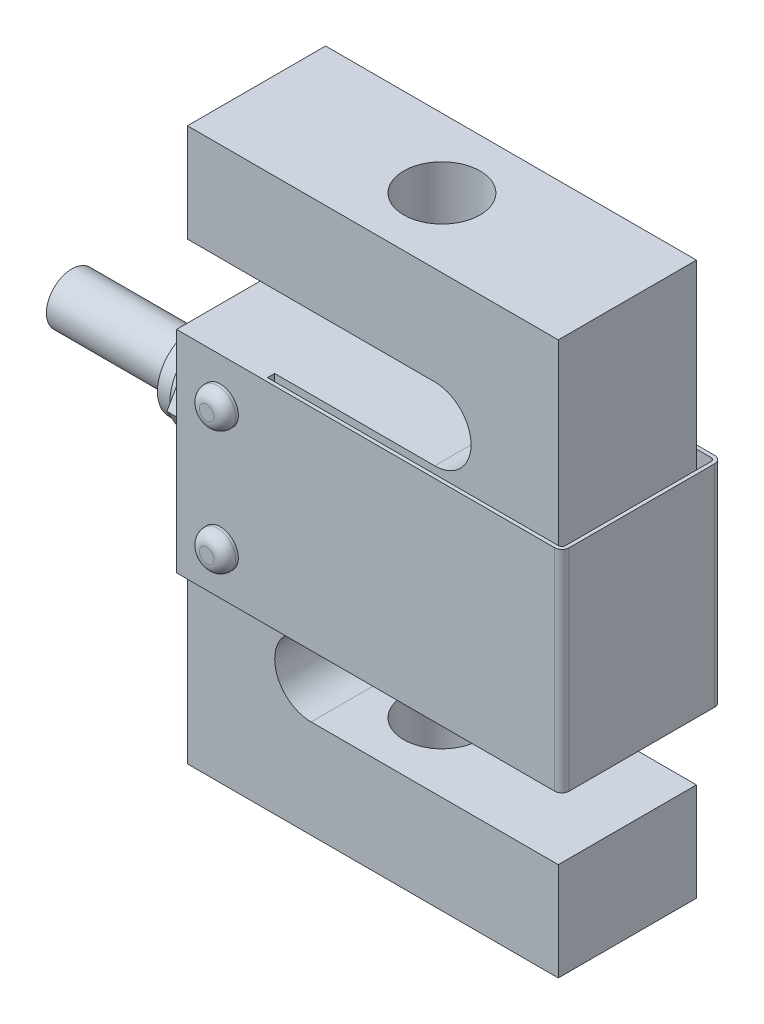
ISO-10303-21;
HEADER;
FILE_DESCRIPTION(('STEP AP214'),'2;1');
FILE_NAME('part.step','',(''),(''),'','','');
FILE_SCHEMA(('AUTOMOTIVE_DESIGN { 1 0 10303 214 1 1 1 1 }'));
ENDSEC;
DATA;
#1=APPLICATION_CONTEXT('core data for automotive mechanical design processes');
#2=APPLICATION_PROTOCOL_DEFINITION('international standard','automotive_design',2000,#1);
#3=PRODUCT_CONTEXT('',#1,'mechanical');
#4=PRODUCT('Part','Part','',(#3));
#5=PRODUCT_RELATED_PRODUCT_CATEGORY('part','',(#4));
#6=PRODUCT_DEFINITION_FORMATION('','',#4);
#7=PRODUCT_DEFINITION_CONTEXT('part definition',#1,'design');
#8=PRODUCT_DEFINITION('design','',#6,#7);
#9=PRODUCT_DEFINITION_SHAPE('','',#8);
#10=(LENGTH_UNIT() NAMED_UNIT(*) SI_UNIT(.MILLI.,.METRE.));
#11=(NAMED_UNIT(*) PLANE_ANGLE_UNIT() SI_UNIT($,.RADIAN.));
#12=(NAMED_UNIT(*) SI_UNIT($,.STERADIAN.) SOLID_ANGLE_UNIT());
#13=UNCERTAINTY_MEASURE_WITH_UNIT(LENGTH_MEASURE(1.E-05),#10,'distance_accuracy_value','');
#14=(GEOMETRIC_REPRESENTATION_CONTEXT(3) GLOBAL_UNCERTAINTY_ASSIGNED_CONTEXT((#13)) GLOBAL_UNIT_ASSIGNED_CONTEXT((#10,
#11,#12)) REPRESENTATION_CONTEXT('',''));
#15=CARTESIAN_POINT('',(0.,0.,0.));
#16=DIRECTION('',(0.,0.,1.));
#17=DIRECTION('',(1.,0.,0.));
#18=AXIS2_PLACEMENT_3D('',#15,#16,#17);
#19=CARTESIAN_POINT('',(26.5,-33.8846669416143,-11.));
#20=DIRECTION('',(0.,0.,-1.));
#21=DIRECTION('',(-1.,0.,0.));
#22=AXIS2_PLACEMENT_3D('',#19,#20,#21);
#23=PLANE('',#22);
#24=CARTESIAN_POINT('',(-19.5,46.5,-11.));
#25=DIRECTION('',(0.,0.,-1.));
#26=DIRECTION('',(-1.,0.,0.));
#27=AXIS2_PLACEMENT_3D('',#24,#25,#26);
#28=CIRCLE('',#27,2.5);
#29=CARTESIAN_POINT('',(-22.,46.5,-11.));
#30=VERTEX_POINT('',#29);
#31=EDGE_CURVE('E512',#30,#30,#28,.F.);
#32=ORIENTED_EDGE('',*,*,#31,.T.);
#33=EDGE_LOOP('',(#32));
#34=FACE_BOUND('',#33,.T.);
#35=DIRECTION('',(1.,0.,0.));
#36=VECTOR('',#35,1.);
#37=CARTESIAN_POINT('',(26.5,23.5,-11.));
#38=LINE('',#37,#36);
#39=CARTESIAN_POINT('',(-25.5,23.5,-11.));
#40=VERTEX_POINT('',#39);
#41=CARTESIAN_POINT('',(26.5,23.5,-11.));
#42=VERTEX_POINT('',#41);
#43=EDGE_CURVE('E322',#40,#42,#38,.T.);
#44=ORIENTED_EDGE('',*,*,#43,.F.);
#45=DIRECTION('',(0.,1.,0.));
#46=VECTOR('',#45,1.);
#47=CARTESIAN_POINT('',(-25.5,-33.8846669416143,-11.));
#48=LINE('',#47,#46);
#49=CARTESIAN_POINT('',(-25.5,52.5,-11.));
#50=VERTEX_POINT('',#49);
#51=EDGE_CURVE('E394',#40,#50,#48,.T.);
#52=ORIENTED_EDGE('',*,*,#51,.T.);
#53=DIRECTION('',(-1.,0.,0.));
#54=VECTOR('',#53,1.);
#55=CARTESIAN_POINT('',(26.5,52.5,-11.));
#56=LINE('',#55,#54);
#57=CARTESIAN_POINT('',(26.5,52.5,-11.));
#58=VERTEX_POINT('',#57);
#59=EDGE_CURVE('E354',#58,#50,#56,.T.);
#60=ORIENTED_EDGE('',*,*,#59,.F.);
#61=DIRECTION('',(0.,1.,0.));
#62=VECTOR('',#61,1.);
#63=CARTESIAN_POINT('',(26.5,-33.8846669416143,-11.));
#64=LINE('',#63,#62);
#65=EDGE_CURVE('E397',#42,#58,#64,.T.);
#66=ORIENTED_EDGE('',*,*,#65,.F.);
#67=EDGE_LOOP('',(#44,#52,#60,#66));
#68=FACE_BOUND('',#67,.T.);
#69=CARTESIAN_POINT('',(-19.5,29.5,-11.));
#70=DIRECTION('',(0.,0.,-1.));
#71=DIRECTION('',(-1.,0.,0.));
#72=AXIS2_PLACEMENT_3D('',#69,#70,#71);
#73=CIRCLE('',#72,2.5);
#74=CARTESIAN_POINT('',(-22.,29.5,-11.));
#75=VERTEX_POINT('',#74);
#76=EDGE_CURVE('E513',#75,#75,#73,.F.);
#77=ORIENTED_EDGE('',*,*,#76,.T.);
#78=EDGE_LOOP('',(#77));
#79=FACE_BOUND('',#78,.T.);
#80=ADVANCED_FACE('F38',(#34,#68,#79),#23,.T.);
#81=CARTESIAN_POINT('',(-25.5,-33.8846669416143,11.));
#82=DIRECTION('',(0.,0.,1.));
#83=DIRECTION('',(1.,0.,0.));
#84=AXIS2_PLACEMENT_3D('',#81,#82,#83);
#85=PLANE('',#84);
#86=CARTESIAN_POINT('',(-19.5,46.5,11.));
#87=DIRECTION('',(0.,0.,1.));
#88=DIRECTION('',(1.,0.,0.));
#89=AXIS2_PLACEMENT_3D('',#86,#87,#88);
#90=CIRCLE('',#89,2.5);
#91=CARTESIAN_POINT('',(-17.,46.5,11.));
#92=VERTEX_POINT('',#91);
#93=EDGE_CURVE('E509',#92,#92,#90,.F.);
#94=ORIENTED_EDGE('',*,*,#93,.T.);
#95=EDGE_LOOP('',(#94));
#96=FACE_BOUND('',#95,.T.);
#97=DIRECTION('',(-1.,0.,0.));
#98=VECTOR('',#97,1.);
#99=CARTESIAN_POINT('',(-25.5,23.5,11.));
#100=LINE('',#99,#98);
#101=CARTESIAN_POINT('',(26.5,23.5,11.));
#102=VERTEX_POINT('',#101);
#103=CARTESIAN_POINT('',(-25.5,23.5,11.));
#104=VERTEX_POINT('',#103);
#105=EDGE_CURVE('E313',#102,#104,#100,.T.);
#106=ORIENTED_EDGE('',*,*,#105,.F.);
#107=DIRECTION('',(0.,1.,0.));
#108=VECTOR('',#107,1.);
#109=CARTESIAN_POINT('',(26.5,-33.8846669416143,11.));
#110=LINE('',#109,#108);
#111=CARTESIAN_POINT('',(26.5,52.5,11.));
#112=VERTEX_POINT('',#111);
#113=EDGE_CURVE('E403',#102,#112,#110,.T.);
#114=ORIENTED_EDGE('',*,*,#113,.T.);
#115=DIRECTION('',(1.,0.,0.));
#116=VECTOR('',#115,1.);
#117=CARTESIAN_POINT('',(-25.5,52.5,11.));
#118=LINE('',#117,#116);
#119=CARTESIAN_POINT('',(-25.5,52.5,11.));
#120=VERTEX_POINT('',#119);
#121=EDGE_CURVE('E312',#120,#112,#118,.T.);
#122=ORIENTED_EDGE('',*,*,#121,.F.);
#123=DIRECTION('',(0.,1.,0.));
#124=VECTOR('',#123,1.);
#125=CARTESIAN_POINT('',(-25.5,-33.8846669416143,11.));
#126=LINE('',#125,#124);
#127=EDGE_CURVE('E378',#104,#120,#126,.T.);
#128=ORIENTED_EDGE('',*,*,#127,.F.);
#129=EDGE_LOOP('',(#106,#114,#122,#128));
#130=FACE_BOUND('',#129,.T.);
#131=CARTESIAN_POINT('',(-19.5,29.5,11.));
#132=DIRECTION('',(0.,0.,1.));
#133=DIRECTION('',(1.,0.,0.));
#134=AXIS2_PLACEMENT_3D('',#131,#132,#133);
#135=CIRCLE('',#134,2.5);
#136=CARTESIAN_POINT('',(-17.,29.5,11.));
#137=VERTEX_POINT('',#136);
#138=EDGE_CURVE('E514',#137,#137,#135,.F.);
#139=ORIENTED_EDGE('',*,*,#138,.T.);
#140=EDGE_LOOP('',(#139));
#141=FACE_BOUND('',#140,.T.);
#142=ADVANCED_FACE('F552',(#96,#130,#141),#85,.T.);
#143=CARTESIAN_POINT('',(-33.9,38.,0.));
#144=DIRECTION('',(-1.,0.,0.));
#145=DIRECTION('',(0.,0.,1.));
#146=AXIS2_PLACEMENT_3D('',#143,#144,#145);
#147=PLANE('',#146);
#148=CARTESIAN_POINT('',(-33.9,38.,0.));
#149=DIRECTION('',(-1.,0.,0.));
#150=DIRECTION('',(0.,0.,1.));
#151=AXIS2_PLACEMENT_3D('',#148,#149,#150);
#152=CIRCLE('',#151,5.225);
#153=CARTESIAN_POINT('',(-33.9,38.,5.225));
#154=VERTEX_POINT('',#153);
#155=EDGE_CURVE('E862',#154,#154,#152,.T.);
#156=ORIENTED_EDGE('',*,*,#155,.T.);
#157=EDGE_LOOP('',(#156));
#158=FACE_BOUND('',#157,.T.);
#159=CARTESIAN_POINT('',(-33.9,38.,0.));
#160=DIRECTION('',(-1.,0.,0.));
#161=DIRECTION('',(0.,0.,1.));
#162=AXIS2_PLACEMENT_3D('',#159,#160,#161);
#163=CIRCLE('',#162,3.5);
#164=CARTESIAN_POINT('',(-33.9,38.,3.5));
#165=VERTEX_POINT('',#164);
#166=EDGE_CURVE('E853',#165,#165,#163,.T.);
#167=ORIENTED_EDGE('',*,*,#166,.F.);
#168=EDGE_LOOP('',(#167));
#169=FACE_BOUND('',#168,.T.);
#170=ADVANCED_FACE('F558',(#158,#169),#147,.T.);
#171=CARTESIAN_POINT('',(-31.9,38.,0.));
#172=DIRECTION('',(-1.,0.,0.));
#173=DIRECTION('',(0.,0.,1.));
#174=AXIS2_PLACEMENT_3D('',#171,#172,#173);
#175=PLANE('',#174);
#176=CARTESIAN_POINT('',(-31.9,38.,0.));
#177=DIRECTION('',(-1.,0.,0.));
#178=DIRECTION('',(0.,0.,1.));
#179=AXIS2_PLACEMENT_3D('',#176,#177,#178);
#180=CIRCLE('',#179,5.5);
#181=CARTESIAN_POINT('',(-31.9,38.,5.5));
#182=VERTEX_POINT('',#181);
#183=EDGE_CURVE('E274',#182,#182,#180,.T.);
#184=ORIENTED_EDGE('',*,*,#183,.T.);
#185=EDGE_LOOP('',(#184));
#186=FACE_BOUND('',#185,.T.);
#187=CARTESIAN_POINT('',(-31.9,38.,0.));
#188=DIRECTION('',(-1.,0.,0.));
#189=DIRECTION('',(0.,0.,1.));
#190=AXIS2_PLACEMENT_3D('',#187,#188,#189);
#191=CIRCLE('',#190,5.225);
#192=CARTESIAN_POINT('',(-31.9,38.,5.225));
#193=VERTEX_POINT('',#192);
#194=EDGE_CURVE('E859',#193,#193,#191,.T.);
#195=ORIENTED_EDGE('',*,*,#194,.F.);
#196=EDGE_LOOP('',(#195));
#197=FACE_BOUND('',#196,.T.);
#198=ADVANCED_FACE('F765',(#186,#197),#175,.T.);
#199=CARTESIAN_POINT('',(-30.9,32.,3.46410161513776));
#200=DIRECTION('',(-1.,0.,0.));
#201=DIRECTION('',(0.,0.,1.));
#202=AXIS2_PLACEMENT_3D('',#199,#200,#201);
#203=PLANE('',#202);
#204=DIRECTION('',(0.,0.,1.));
#205=VECTOR('',#204,1.);
#206=CARTESIAN_POINT('',(-30.9,32.,-3.46410161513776));
#207=LINE('',#206,#205);
#208=CARTESIAN_POINT('',(-30.9,32.,-3.46410161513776));
#209=VERTEX_POINT('',#208);
#210=CARTESIAN_POINT('',(-30.9,32.,3.46410161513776));
#211=VERTEX_POINT('',#210);
#212=EDGE_CURVE('E288',#209,#211,#207,.T.);
#213=ORIENTED_EDGE('',*,*,#212,.T.);
#214=DIRECTION('',(0.,0.866025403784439,0.5));
#215=VECTOR('',#214,1.);
#216=CARTESIAN_POINT('',(-30.9,32.,3.46410161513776));
#217=LINE('',#216,#215);
#218=CARTESIAN_POINT('',(-30.9,38.,6.92820323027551));
#219=VERTEX_POINT('',#218);
#220=EDGE_CURVE('E263',#211,#219,#217,.T.);
#221=ORIENTED_EDGE('',*,*,#220,.T.);
#222=DIRECTION('',(0.,0.866025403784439,-0.5));
#223=VECTOR('',#222,1.);
#224=CARTESIAN_POINT('',(-30.9,38.,6.92820323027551));
#225=LINE('',#224,#223);
#226=CARTESIAN_POINT('',(-30.9,44.,3.46410161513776));
#227=VERTEX_POINT('',#226);
#228=EDGE_CURVE('E291',#219,#227,#225,.T.);
#229=ORIENTED_EDGE('',*,*,#228,.T.);
#230=DIRECTION('',(0.,0.,-1.));
#231=VECTOR('',#230,1.);
#232=CARTESIAN_POINT('',(-30.9,44.,3.46410161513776));
#233=LINE('',#232,#231);
#234=CARTESIAN_POINT('',(-30.9,44.,-3.46410161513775));
#235=VERTEX_POINT('',#234);
#236=EDGE_CURVE('E293',#227,#235,#233,.T.);
#237=ORIENTED_EDGE('',*,*,#236,.T.);
#238=DIRECTION('',(0.,-0.866025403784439,-0.5));
#239=VECTOR('',#238,1.);
#240=CARTESIAN_POINT('',(-30.9,44.,-3.46410161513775));
#241=LINE('',#240,#239);
#242=CARTESIAN_POINT('',(-30.9,38.,-6.92820323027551));
#243=VERTEX_POINT('',#242);
#244=EDGE_CURVE('E295',#235,#243,#241,.T.);
#245=ORIENTED_EDGE('',*,*,#244,.T.);
#246=DIRECTION('',(0.,-0.866025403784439,0.5));
#247=VECTOR('',#246,1.);
#248=CARTESIAN_POINT('',(-30.9,38.,-6.92820323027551));
#249=LINE('',#248,#247);
#250=EDGE_CURVE('E297',#243,#209,#249,.T.);
#251=ORIENTED_EDGE('',*,*,#250,.T.);
#252=EDGE_LOOP('',(#213,#221,#229,#237,#245,#251));
#253=FACE_BOUND('',#252,.T.);
#254=CARTESIAN_POINT('',(-30.9,38.,0.));
#255=DIRECTION('',(-1.,0.,0.));
#256=DIRECTION('',(0.,0.,1.));
#257=AXIS2_PLACEMENT_3D('',#254,#255,#256);
#258=CIRCLE('',#257,5.5);
#259=CARTESIAN_POINT('',(-30.9,38.,5.5));
#260=VERTEX_POINT('',#259);
#261=EDGE_CURVE('E277',#260,#260,#258,.T.);
#262=ORIENTED_EDGE('',*,*,#261,.F.);
#263=EDGE_LOOP('',(#262));
#264=FACE_BOUND('',#263,.T.);
#265=ADVANCED_FACE('F641',(#253,#264),#203,.T.);
#266=CARTESIAN_POINT('',(-25.5,52.5,9.5));
#267=DIRECTION('',(1.,0.,0.));
#268=DIRECTION('',(0.,1.,0.));
#269=AXIS2_PLACEMENT_3D('',#266,#267,#268);
#270=PLANE('',#269);
#271=DIRECTION('',(0.,0.,-1.));
#272=VECTOR('',#271,1.);
#273=CARTESIAN_POINT('',(-25.5,52.5,9.5));
#274=LINE('',#273,#272);
#275=EDGE_CURVE('E470',#120,#50,#274,.T.);
#276=ORIENTED_EDGE('',*,*,#275,.T.);
#277=ORIENTED_EDGE('',*,*,#51,.F.);
#278=DIRECTION('',(0.,0.,-1.));
#279=VECTOR('',#278,1.);
#280=CARTESIAN_POINT('',(-25.5,23.5,-11.));
#281=LINE('',#280,#279);
#282=CARTESIAN_POINT('',(-25.5,23.5,-9.5));
#283=VERTEX_POINT('',#282);
#284=EDGE_CURVE('E324',#283,#40,#281,.T.);
#285=ORIENTED_EDGE('',*,*,#284,.F.);
#286=DIRECTION('',(0.,-1.,0.));
#287=VECTOR('',#286,1.);
#288=CARTESIAN_POINT('',(-25.5,52.5,-9.5));
#289=LINE('',#288,#287);
#290=CARTESIAN_POINT('',(-25.5,0.,-9.5));
#291=VERTEX_POINT('',#290);
#292=EDGE_CURVE('E420',#283,#291,#289,.T.);
#293=ORIENTED_EDGE('',*,*,#292,.T.);
#294=DIRECTION('',(0.,0.,-1.));
#295=VECTOR('',#294,1.);
#296=CARTESIAN_POINT('',(-25.5,0.,9.5));
#297=LINE('',#296,#295);
#298=CARTESIAN_POINT('',(-25.5,0.,9.5));
#299=VERTEX_POINT('',#298);
#300=EDGE_CURVE('E502',#299,#291,#297,.T.);
#301=ORIENTED_EDGE('',*,*,#300,.F.);
#302=DIRECTION('',(0.,-1.,0.));
#303=VECTOR('',#302,1.);
#304=CARTESIAN_POINT('',(-25.5,52.5,9.5));
#305=LINE('',#304,#303);
#306=CARTESIAN_POINT('',(-25.5,23.5,9.5));
#307=VERTEX_POINT('',#306);
#308=EDGE_CURVE('E445',#307,#299,#305,.T.);
#309=ORIENTED_EDGE('',*,*,#308,.F.);
#310=DIRECTION('',(0.,0.,-1.));
#311=VECTOR('',#310,1.);
#312=CARTESIAN_POINT('',(-25.5,23.5,9.5));
#313=LINE('',#312,#311);
#314=EDGE_CURVE('E53',#104,#307,#313,.T.);
#315=ORIENTED_EDGE('',*,*,#314,.F.);
#316=ORIENTED_EDGE('',*,*,#127,.T.);
#317=EDGE_LOOP('',(#276,#277,#285,#293,#301,#309,#315,#316));
#318=FACE_BOUND('',#317,.T.);
#319=CARTESIAN_POINT('',(-25.5,38.,0.));
#320=DIRECTION('',(1.,0.,0.));
#321=DIRECTION('',(0.,1.,0.));
#322=AXIS2_PLACEMENT_3D('',#319,#320,#321);
#323=CIRCLE('',#322,5.5);
#324=CARTESIAN_POINT('',(-25.5,43.5,0.));
#325=VERTEX_POINT('',#324);
#326=EDGE_CURVE('E505',#325,#325,#323,.F.);
#327=ORIENTED_EDGE('',*,*,#326,.F.);
#328=EDGE_LOOP('',(#327));
#329=FACE_BOUND('',#328,.T.);
#330=ADVANCED_FACE('F40',(#318,#329),#270,.F.);
#331=CARTESIAN_POINT('',(-25.5,0.,9.5));
#332=DIRECTION('',(0.,1.,0.));
#333=DIRECTION('',(0.,0.,1.));
#334=AXIS2_PLACEMENT_3D('',#331,#332,#333);
#335=PLANE('',#334);
#336=CARTESIAN_POINT('',(0.,0.,0.));
#337=DIRECTION('',(0.,-1.,0.));
#338=DIRECTION('',(0.,0.,-1.));
#339=AXIS2_PLACEMENT_3D('',#336,#337,#338);
#340=CIRCLE('',#339,5.24999999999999);
#341=CARTESIAN_POINT('',(0.,0.,-5.24999999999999));
#342=VERTEX_POINT('',#341);
#343=EDGE_CURVE('E414',#342,#342,#340,.T.);
#344=ORIENTED_EDGE('',*,*,#343,.F.);
#345=EDGE_LOOP('',(#344));
#346=FACE_BOUND('',#345,.T.);
#347=DIRECTION('',(1.,0.,0.));
#348=VECTOR('',#347,1.);
#349=CARTESIAN_POINT('',(-25.5,0.,-9.5));
#350=LINE('',#349,#348);
#351=CARTESIAN_POINT('',(25.5,0.,-9.5));
#352=VERTEX_POINT('',#351);
#353=EDGE_CURVE('E422',#291,#352,#350,.T.);
#354=ORIENTED_EDGE('',*,*,#353,.T.);
#355=DIRECTION('',(0.,0.,-1.));
#356=VECTOR('',#355,1.);
#357=CARTESIAN_POINT('',(25.5,0.,9.5));
#358=LINE('',#357,#356);
#359=CARTESIAN_POINT('',(25.5,0.,9.5));
#360=VERTEX_POINT('',#359);
#361=EDGE_CURVE('E499',#360,#352,#358,.T.);
#362=ORIENTED_EDGE('',*,*,#361,.F.);
#363=DIRECTION('',(1.,0.,0.));
#364=VECTOR('',#363,1.);
#365=CARTESIAN_POINT('',(-25.5,0.,9.5));
#366=LINE('',#365,#364);
#367=EDGE_CURVE('E447',#299,#360,#366,.T.);
#368=ORIENTED_EDGE('',*,*,#367,.F.);
#369=ORIENTED_EDGE('',*,*,#300,.T.);
#370=EDGE_LOOP('',(#354,#362,#368,#369));
#371=FACE_BOUND('',#370,.T.);
#372=ADVANCED_FACE('F634',(#346,#371),#335,.F.);
#373=CARTESIAN_POINT('',(25.5,0.,9.5));
#374=DIRECTION('',(-1.,0.,0.));
#375=DIRECTION('',(0.,0.,1.));
#376=AXIS2_PLACEMENT_3D('',#373,#374,#375);
#377=PLANE('',#376);
#378=DIRECTION('',(0.,1.,0.));
#379=VECTOR('',#378,1.);
#380=CARTESIAN_POINT('',(25.5,0.,-9.5));
#381=LINE('',#380,#379);
#382=CARTESIAN_POINT('',(25.5,13.5,-9.5));
#383=VERTEX_POINT('',#382);
#384=EDGE_CURVE('E424',#352,#383,#381,.T.);
#385=ORIENTED_EDGE('',*,*,#384,.T.);
#386=DIRECTION('',(0.,0.,-1.));
#387=VECTOR('',#386,1.);
#388=CARTESIAN_POINT('',(25.5,13.5,9.5));
#389=LINE('',#388,#387);
#390=CARTESIAN_POINT('',(25.5,13.5,9.5));
#391=VERTEX_POINT('',#390);
#392=EDGE_CURVE('E496',#391,#383,#389,.T.);
#393=ORIENTED_EDGE('',*,*,#392,.F.);
#394=DIRECTION('',(0.,1.,0.));
#395=VECTOR('',#394,1.);
#396=CARTESIAN_POINT('',(25.5,0.,9.5));
#397=LINE('',#396,#395);
#398=EDGE_CURVE('E449',#360,#391,#397,.T.);
#399=ORIENTED_EDGE('',*,*,#398,.F.);
#400=ORIENTED_EDGE('',*,*,#361,.T.);
#401=EDGE_LOOP('',(#385,#393,#399,#400));
#402=FACE_BOUND('',#401,.T.);
#403=ADVANCED_FACE('F631',(#402),#377,.F.);
#404=CARTESIAN_POINT('',(25.5,13.5,9.5));
#405=DIRECTION('',(0.,-1.,0.));
#406=DIRECTION('',(1.,0.,0.));
#407=AXIS2_PLACEMENT_3D('',#404,#405,#406);
#408=PLANE('',#407);
#409=CARTESIAN_POINT('',(0.,13.5,0.));
#410=DIRECTION('',(0.,-1.,0.));
#411=DIRECTION('',(1.,0.,0.));
#412=AXIS2_PLACEMENT_3D('',#409,#410,#411);
#413=CIRCLE('',#412,5.24999999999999);
#414=CARTESIAN_POINT('',(5.24999999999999,13.5,0.));
#415=VERTEX_POINT('',#414);
#416=EDGE_CURVE('E417',#415,#415,#413,.T.);
#417=ORIENTED_EDGE('',*,*,#416,.T.);
#418=EDGE_LOOP('',(#417));
#419=FACE_BOUND('',#418,.T.);
#420=DIRECTION('',(-1.,0.,0.));
#421=VECTOR('',#420,1.);
#422=CARTESIAN_POINT('',(25.5,13.5,-9.5));
#423=LINE('',#422,#421);
#424=CARTESIAN_POINT('',(-8.5,13.5,-9.5));
#425=VERTEX_POINT('',#424);
#426=EDGE_CURVE('E426',#383,#425,#423,.T.);
#427=ORIENTED_EDGE('',*,*,#426,.T.);
#428=DIRECTION('',(0.,0.,-1.));
#429=VECTOR('',#428,1.);
#430=CARTESIAN_POINT('',(-8.5,13.5,9.5));
#431=LINE('',#430,#429);
#432=CARTESIAN_POINT('',(-8.5,13.5,9.5));
#433=VERTEX_POINT('',#432);
#434=EDGE_CURVE('E493',#433,#425,#431,.T.);
#435=ORIENTED_EDGE('',*,*,#434,.F.);
#436=DIRECTION('',(-1.,0.,0.));
#437=VECTOR('',#436,1.);
#438=CARTESIAN_POINT('',(25.5,13.5,9.5));
#439=LINE('',#438,#437);
#440=EDGE_CURVE('E451',#391,#433,#439,.T.);
#441=ORIENTED_EDGE('',*,*,#440,.F.);
#442=ORIENTED_EDGE('',*,*,#392,.T.);
#443=EDGE_LOOP('',(#427,#435,#441,#442));
#444=FACE_BOUND('',#443,.T.);
#445=ADVANCED_FACE('F627',(#419,#444),#408,.F.);
#446=CARTESIAN_POINT('',(-8.5,18.5,9.5));
#447=DIRECTION('',(0.,0.,-1.));
#448=DIRECTION('',(-1.,0.,0.));
#449=AXIS2_PLACEMENT_3D('',#446,#447,#448);
#450=CYLINDRICAL_SURFACE('',#449,5.);
#451=CARTESIAN_POINT('',(-8.5,18.5,-9.5));
#452=DIRECTION('',(0.,0.,-1.));
#453=DIRECTION('',(1.,0.,0.));
#454=AXIS2_PLACEMENT_3D('',#451,#452,#453);
#455=CIRCLE('',#454,5.);
#456=CARTESIAN_POINT('',(-8.5,23.5,-9.5));
#457=VERTEX_POINT('',#456);
#458=EDGE_CURVE('E428',#425,#457,#455,.T.);
#459=ORIENTED_EDGE('',*,*,#458,.T.);
#460=DIRECTION('',(0.,0.,-1.));
#461=VECTOR('',#460,1.);
#462=CARTESIAN_POINT('',(-8.5,23.5,9.5));
#463=LINE('',#462,#461);
#464=CARTESIAN_POINT('',(-8.5,23.5,9.5));
#465=VERTEX_POINT('',#464);
#466=EDGE_CURVE('E490',#465,#457,#463,.T.);
#467=ORIENTED_EDGE('',*,*,#466,.F.);
#468=CARTESIAN_POINT('',(-8.5,18.5,9.5));
#469=DIRECTION('',(0.,0.,-1.));
#470=DIRECTION('',(1.,0.,0.));
#471=AXIS2_PLACEMENT_3D('',#468,#469,#470);
#472=CIRCLE('',#471,5.);
#473=EDGE_CURVE('E453',#433,#465,#472,.T.);
#474=ORIENTED_EDGE('',*,*,#473,.F.);
#475=ORIENTED_EDGE('',*,*,#434,.T.);
#476=EDGE_LOOP('',(#459,#467,#474,#475));
#477=FACE_BOUND('',#476,.T.);
#478=ADVANCED_FACE('F623',(#477),#450,.F.);
#479=CARTESIAN_POINT('',(-8.5,23.5,9.5));
#480=DIRECTION('',(0.,1.,0.));
#481=DIRECTION('',(0.,0.,1.));
#482=AXIS2_PLACEMENT_3D('',#479,#480,#481);
#483=PLANE('',#482);
#484=DIRECTION('',(1.,0.,0.));
#485=VECTOR('',#484,1.);
#486=CARTESIAN_POINT('',(-8.5,23.5,-9.5));
#487=LINE('',#486,#485);
#488=CARTESIAN_POINT('',(25.5,23.5,-9.5));
#489=VERTEX_POINT('',#488);
#490=EDGE_CURVE('E430',#457,#489,#487,.T.);
#491=ORIENTED_EDGE('',*,*,#490,.T.);
#492=DIRECTION('',(0.,0.,-1.));
#493=VECTOR('',#492,1.);
#494=CARTESIAN_POINT('',(25.5,23.5,9.5));
#495=LINE('',#494,#493);
#496=CARTESIAN_POINT('',(25.5,23.5,9.5));
#497=VERTEX_POINT('',#496);
#498=EDGE_CURVE('E487',#497,#489,#495,.T.);
#499=ORIENTED_EDGE('',*,*,#498,.F.);
#500=DIRECTION('',(1.,0.,0.));
#501=VECTOR('',#500,1.);
#502=CARTESIAN_POINT('',(-8.5,23.5,9.5));
#503=LINE('',#502,#501);
#504=EDGE_CURVE('E455',#465,#497,#503,.T.);
#505=ORIENTED_EDGE('',*,*,#504,.F.);
#506=ORIENTED_EDGE('',*,*,#466,.T.);
#507=EDGE_LOOP('',(#491,#499,#505,#506));
#508=FACE_BOUND('',#507,.T.);
#509=ADVANCED_FACE('F619',(#508),#483,.F.);
#510=CARTESIAN_POINT('',(25.5,23.5,9.5));
#511=DIRECTION('',(-1.,0.,0.));
#512=DIRECTION('',(0.,0.,1.));
#513=AXIS2_PLACEMENT_3D('',#510,#511,#512);
#514=PLANE('',#513);
#515=DIRECTION('',(0.,1.,0.));
#516=VECTOR('',#515,1.);
#517=CARTESIAN_POINT('',(25.5,23.5,-9.5));
#518=LINE('',#517,#516);
#519=CARTESIAN_POINT('',(25.5,76.,-9.5));
#520=VERTEX_POINT('',#519);
#521=EDGE_CURVE('E432',#489,#520,#518,.T.);
#522=ORIENTED_EDGE('',*,*,#521,.T.);
#523=DIRECTION('',(0.,0.,-1.));
#524=VECTOR('',#523,1.);
#525=CARTESIAN_POINT('',(25.5,76.,9.5));
#526=LINE('',#525,#524);
#527=CARTESIAN_POINT('',(25.5,76.,9.5));
#528=VERTEX_POINT('',#527);
#529=EDGE_CURVE('E484',#528,#520,#526,.T.);
#530=ORIENTED_EDGE('',*,*,#529,.F.);
#531=DIRECTION('',(0.,1.,0.));
#532=VECTOR('',#531,1.);
#533=CARTESIAN_POINT('',(25.5,23.5,9.5));
#534=LINE('',#533,#532);
#535=EDGE_CURVE('E457',#497,#528,#534,.T.);
#536=ORIENTED_EDGE('',*,*,#535,.F.);
#537=ORIENTED_EDGE('',*,*,#498,.T.);
#538=EDGE_LOOP('',(#522,#530,#536,#537));
#539=FACE_BOUND('',#538,.T.);
#540=ADVANCED_FACE('F615',(#539),#514,.F.);
#541=CARTESIAN_POINT('',(25.5,76.,9.5));
#542=DIRECTION('',(0.,-1.,0.));
#543=DIRECTION('',(1.,0.,0.));
#544=AXIS2_PLACEMENT_3D('',#541,#542,#543);
#545=PLANE('',#544);
#546=CARTESIAN_POINT('',(0.,76.,0.));
#547=DIRECTION('',(0.,1.,0.));
#548=DIRECTION('',(0.,0.,1.));
#549=AXIS2_PLACEMENT_3D('',#546,#547,#548);
#550=CIRCLE('',#549,5.24999999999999);
#551=CARTESIAN_POINT('',(0.,76.,5.24999999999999));
#552=VERTEX_POINT('',#551);
#553=EDGE_CURVE('E408',#552,#552,#550,.T.);
#554=ORIENTED_EDGE('',*,*,#553,.F.);
#555=EDGE_LOOP('',(#554));
#556=FACE_BOUND('',#555,.T.);
#557=DIRECTION('',(-1.,0.,0.));
#558=VECTOR('',#557,1.);
#559=CARTESIAN_POINT('',(25.5,76.,-9.5));
#560=LINE('',#559,#558);
#561=CARTESIAN_POINT('',(-25.5,76.,-9.5));
#562=VERTEX_POINT('',#561);
#563=EDGE_CURVE('E434',#520,#562,#560,.T.);
#564=ORIENTED_EDGE('',*,*,#563,.T.);
#565=DIRECTION('',(0.,0.,-1.));
#566=VECTOR('',#565,1.);
#567=CARTESIAN_POINT('',(-25.5,76.,9.5));
#568=LINE('',#567,#566);
#569=CARTESIAN_POINT('',(-25.5,76.,9.5));
#570=VERTEX_POINT('',#569);
#571=EDGE_CURVE('E481',#570,#562,#568,.T.);
#572=ORIENTED_EDGE('',*,*,#571,.F.);
#573=DIRECTION('',(-1.,0.,0.));
#574=VECTOR('',#573,1.);
#575=CARTESIAN_POINT('',(25.5,76.,9.5));
#576=LINE('',#575,#574);
#577=EDGE_CURVE('E459',#528,#570,#576,.T.);
#578=ORIENTED_EDGE('',*,*,#577,.F.);
#579=ORIENTED_EDGE('',*,*,#529,.T.);
#580=EDGE_LOOP('',(#564,#572,#578,#579));
#581=FACE_BOUND('',#580,.T.);
#582=ADVANCED_FACE('F611',(#556,#581),#545,.F.);
#583=CARTESIAN_POINT('',(-25.5,76.,9.5));
#584=DIRECTION('',(1.,0.,0.));
#585=DIRECTION('',(0.,0.,-1.));
#586=AXIS2_PLACEMENT_3D('',#583,#584,#585);
#587=PLANE('',#586);
#588=DIRECTION('',(0.,-1.,0.));
#589=VECTOR('',#588,1.);
#590=CARTESIAN_POINT('',(-25.5,76.,-9.5));
#591=LINE('',#590,#589);
#592=CARTESIAN_POINT('',(-25.5,62.5,-9.5));
#593=VERTEX_POINT('',#592);
#594=EDGE_CURVE('E436',#562,#593,#591,.T.);
#595=ORIENTED_EDGE('',*,*,#594,.T.);
#596=DIRECTION('',(0.,0.,-1.));
#597=VECTOR('',#596,1.);
#598=CARTESIAN_POINT('',(-25.5,62.5,9.5));
#599=LINE('',#598,#597);
#600=CARTESIAN_POINT('',(-25.5,62.5,9.5));
#601=VERTEX_POINT('',#600);
#602=EDGE_CURVE('E478',#601,#593,#599,.T.);
#603=ORIENTED_EDGE('',*,*,#602,.F.);
#604=DIRECTION('',(0.,-1.,0.));
#605=VECTOR('',#604,1.);
#606=CARTESIAN_POINT('',(-25.5,76.,9.5));
#607=LINE('',#606,#605);
#608=EDGE_CURVE('E461',#570,#601,#607,.T.);
#609=ORIENTED_EDGE('',*,*,#608,.F.);
#610=ORIENTED_EDGE('',*,*,#571,.T.);
#611=EDGE_LOOP('',(#595,#603,#609,#610));
#612=FACE_BOUND('',#611,.T.);
#613=ADVANCED_FACE('F607',(#612),#587,.F.);
#614=CARTESIAN_POINT('',(-25.5,62.5,9.5));
#615=DIRECTION('',(0.,1.,0.));
#616=DIRECTION('',(-1.,0.,0.));
#617=AXIS2_PLACEMENT_3D('',#614,#615,#616);
#618=PLANE('',#617);
#619=CARTESIAN_POINT('',(0.,62.5,0.));
#620=DIRECTION('',(0.,1.,0.));
#621=DIRECTION('',(-1.,0.,0.));
#622=AXIS2_PLACEMENT_3D('',#619,#620,#621);
#623=CIRCLE('',#622,5.24999999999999);
#624=CARTESIAN_POINT('',(-5.24999999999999,62.5,0.));
#625=VERTEX_POINT('',#624);
#626=EDGE_CURVE('E411',#625,#625,#623,.T.);
#627=ORIENTED_EDGE('',*,*,#626,.T.);
#628=EDGE_LOOP('',(#627));
#629=FACE_BOUND('',#628,.T.);
#630=DIRECTION('',(1.,0.,0.));
#631=VECTOR('',#630,1.);
#632=CARTESIAN_POINT('',(-25.5,62.5,-9.5));
#633=LINE('',#632,#631);
#634=CARTESIAN_POINT('',(8.49999999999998,62.5,-9.5));
#635=VERTEX_POINT('',#634);
#636=EDGE_CURVE('E438',#593,#635,#633,.T.);
#637=ORIENTED_EDGE('',*,*,#636,.T.);
#638=DIRECTION('',(0.,0.,-1.));
#639=VECTOR('',#638,1.);
#640=CARTESIAN_POINT('',(8.49999999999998,62.5,9.5));
#641=LINE('',#640,#639);
#642=CARTESIAN_POINT('',(8.49999999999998,62.5,9.5));
#643=VERTEX_POINT('',#642);
#644=EDGE_CURVE('E475',#643,#635,#641,.T.);
#645=ORIENTED_EDGE('',*,*,#644,.F.);
#646=DIRECTION('',(1.,0.,0.));
#647=VECTOR('',#646,1.);
#648=CARTESIAN_POINT('',(-25.5,62.5,9.5));
#649=LINE('',#648,#647);
#650=EDGE_CURVE('E463',#601,#643,#649,.T.);
#651=ORIENTED_EDGE('',*,*,#650,.F.);
#652=ORIENTED_EDGE('',*,*,#602,.T.);
#653=EDGE_LOOP('',(#637,#645,#651,#652));
#654=FACE_BOUND('',#653,.T.);
#655=ADVANCED_FACE('F603',(#629,#654),#618,.F.);
#656=CARTESIAN_POINT('',(8.49999999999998,57.5,9.5));
#657=DIRECTION('',(0.,0.,-1.));
#658=DIRECTION('',(-1.,0.,0.));
#659=AXIS2_PLACEMENT_3D('',#656,#657,#658);
#660=CYLINDRICAL_SURFACE('',#659,5.);
#661=CARTESIAN_POINT('',(8.49999999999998,57.5,-9.5));
#662=DIRECTION('',(0.,0.,-1.));
#663=DIRECTION('',(1.,0.,0.));
#664=AXIS2_PLACEMENT_3D('',#661,#662,#663);
#665=CIRCLE('',#664,5.);
#666=CARTESIAN_POINT('',(8.49999999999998,52.5,-9.5));
#667=VERTEX_POINT('',#666);
#668=EDGE_CURVE('E440',#635,#667,#665,.T.);
#669=ORIENTED_EDGE('',*,*,#668,.T.);
#670=DIRECTION('',(0.,0.,-1.));
#671=VECTOR('',#670,1.);
#672=CARTESIAN_POINT('',(8.49999999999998,52.5,9.5));
#673=LINE('',#672,#671);
#674=CARTESIAN_POINT('',(8.49999999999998,52.5,9.5));
#675=VERTEX_POINT('',#674);
#676=EDGE_CURVE('E472',#675,#667,#673,.T.);
#677=ORIENTED_EDGE('',*,*,#676,.F.);
#678=CARTESIAN_POINT('',(8.49999999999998,57.5,9.5));
#679=DIRECTION('',(0.,0.,-1.));
#680=DIRECTION('',(1.,0.,0.));
#681=AXIS2_PLACEMENT_3D('',#678,#679,#680);
#682=CIRCLE('',#681,5.);
#683=EDGE_CURVE('E465',#643,#675,#682,.T.);
#684=ORIENTED_EDGE('',*,*,#683,.F.);
#685=ORIENTED_EDGE('',*,*,#644,.T.);
#686=EDGE_LOOP('',(#669,#677,#684,#685));
#687=FACE_BOUND('',#686,.T.);
#688=ADVANCED_FACE('F599',(#687),#660,.F.);
#689=CARTESIAN_POINT('',(8.49999999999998,52.5,9.5));
#690=DIRECTION('',(0.,-1.,0.));
#691=DIRECTION('',(0.,0.,-1.));
#692=AXIS2_PLACEMENT_3D('',#689,#690,#691);
#693=PLANE('',#692);
#694=ORIENTED_EDGE('',*,*,#275,.F.);
#695=ORIENTED_EDGE('',*,*,#121,.T.);
#696=CARTESIAN_POINT('',(26.5,52.5,9.99999999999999));
#697=DIRECTION('',(0.,1.,0.));
#698=DIRECTION('',(0.,0.,1.));
#699=AXIS2_PLACEMENT_3D('',#696,#697,#698);
#700=CIRCLE('',#699,1.);
#701=CARTESIAN_POINT('',(27.5,52.5,9.99999999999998));
#702=VERTEX_POINT('',#701);
#703=EDGE_CURVE('E345',#112,#702,#700,.T.);
#704=ORIENTED_EDGE('',*,*,#703,.T.);
#705=DIRECTION('',(0.,0.,-1.));
#706=VECTOR('',#705,1.);
#707=CARTESIAN_POINT('',(27.5,52.5,9.99999999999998));
#708=LINE('',#707,#706);
#709=CARTESIAN_POINT('',(27.5,52.5,-10.));
#710=VERTEX_POINT('',#709);
#711=EDGE_CURVE('E348',#702,#710,#708,.T.);
#712=ORIENTED_EDGE('',*,*,#711,.T.);
#713=CARTESIAN_POINT('',(26.5,52.5,-10.));
#714=DIRECTION('',(0.,1.,0.));
#715=DIRECTION('',(0.,0.,1.));
#716=AXIS2_PLACEMENT_3D('',#713,#714,#715);
#717=CIRCLE('',#716,1.);
#718=EDGE_CURVE('E351',#710,#58,#717,.T.);
#719=ORIENTED_EDGE('',*,*,#718,.T.);
#720=ORIENTED_EDGE('',*,*,#59,.T.);
#721=EDGE_LOOP('',(#694,#695,#704,#712,#719,#720));
#722=FACE_BOUND('',#721,.T.);
#723=DIRECTION('',(-1.,0.,0.));
#724=VECTOR('',#723,1.);
#725=CARTESIAN_POINT('',(8.49999999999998,52.5,-9.5));
#726=LINE('',#725,#724);
#727=CARTESIAN_POINT('',(-13.5,52.5,-9.5));
#728=VERTEX_POINT('',#727);
#729=EDGE_CURVE('E442',#667,#728,#726,.T.);
#730=ORIENTED_EDGE('',*,*,#729,.T.);
#731=DIRECTION('',(0.,0.,-1.));
#732=VECTOR('',#731,1.);
#733=CARTESIAN_POINT('',(-13.5,52.5,-9.5));
#734=LINE('',#733,#732);
#735=CARTESIAN_POINT('',(-13.5,52.5,-10.5));
#736=VERTEX_POINT('',#735);
#737=EDGE_CURVE('E357',#728,#736,#734,.T.);
#738=ORIENTED_EDGE('',*,*,#737,.T.);
#739=DIRECTION('',(1.,0.,0.));
#740=VECTOR('',#739,1.);
#741=CARTESIAN_POINT('',(-13.5,52.5,-10.5));
#742=LINE('',#741,#740);
#743=CARTESIAN_POINT('',(26.5,52.5,-10.5));
#744=VERTEX_POINT('',#743);
#745=EDGE_CURVE('E360',#736,#744,#742,.T.);
#746=ORIENTED_EDGE('',*,*,#745,.T.);
#747=CARTESIAN_POINT('',(26.5,52.5,-10.));
#748=DIRECTION('',(0.,-1.,0.));
#749=DIRECTION('',(0.,0.,-1.));
#750=AXIS2_PLACEMENT_3D('',#747,#748,#749);
#751=CIRCLE('',#750,0.5);
#752=CARTESIAN_POINT('',(27.,52.5,-10.));
#753=VERTEX_POINT('',#752);
#754=EDGE_CURVE('E363',#744,#753,#751,.T.);
#755=ORIENTED_EDGE('',*,*,#754,.T.);
#756=DIRECTION('',(0.,0.,1.));
#757=VECTOR('',#756,1.);
#758=CARTESIAN_POINT('',(27.,52.5,-10.));
#759=LINE('',#758,#757);
#760=CARTESIAN_POINT('',(27.,52.5,9.99999999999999));
#761=VERTEX_POINT('',#760);
#762=EDGE_CURVE('E366',#753,#761,#759,.T.);
#763=ORIENTED_EDGE('',*,*,#762,.T.);
#764=CARTESIAN_POINT('',(26.5,52.5,9.99999999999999));
#765=DIRECTION('',(0.,-1.,0.));
#766=DIRECTION('',(0.,0.,-1.));
#767=AXIS2_PLACEMENT_3D('',#764,#765,#766);
#768=CIRCLE('',#767,0.5);
#769=CARTESIAN_POINT('',(26.5,52.5,10.5));
#770=VERTEX_POINT('',#769);
#771=EDGE_CURVE('E369',#761,#770,#768,.T.);
#772=ORIENTED_EDGE('',*,*,#771,.T.);
#773=DIRECTION('',(-1.,0.,0.));
#774=VECTOR('',#773,1.);
#775=CARTESIAN_POINT('',(26.5,52.5,10.5));
#776=LINE('',#775,#774);
#777=CARTESIAN_POINT('',(-13.5,52.5,10.5));
#778=VERTEX_POINT('',#777);
#779=EDGE_CURVE('E372',#770,#778,#776,.T.);
#780=ORIENTED_EDGE('',*,*,#779,.T.);
#781=DIRECTION('',(0.,0.,-1.));
#782=VECTOR('',#781,1.);
#783=CARTESIAN_POINT('',(-13.5,52.5,10.5));
#784=LINE('',#783,#782);
#785=CARTESIAN_POINT('',(-13.5,52.5,9.5));
#786=VERTEX_POINT('',#785);
#787=EDGE_CURVE('E375',#778,#786,#784,.T.);
#788=ORIENTED_EDGE('',*,*,#787,.T.);
#789=DIRECTION('',(-1.,0.,0.));
#790=VECTOR('',#789,1.);
#791=CARTESIAN_POINT('',(8.49999999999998,52.5,9.5));
#792=LINE('',#791,#790);
#793=EDGE_CURVE('E467',#675,#786,#792,.T.);
#794=ORIENTED_EDGE('',*,*,#793,.F.);
#795=ORIENTED_EDGE('',*,*,#676,.T.);
#796=EDGE_LOOP('',(#730,#738,#746,#755,#763,#772,#780,#788,#794,#795));
#797=FACE_BOUND('',#796,.T.);
#798=ADVANCED_FACE('F595',(#722,#797),#693,.F.);
#799=CARTESIAN_POINT('',(-8.5,18.5,9.5));
#800=DIRECTION('',(0.,0.,1.));
#801=DIRECTION('',(1.,0.,0.));
#802=AXIS2_PLACEMENT_3D('',#799,#800,#801);
#803=PLANE('',#802);
#804=DIRECTION('',(0.,1.,0.));
#805=VECTOR('',#804,1.);
#806=CARTESIAN_POINT('',(-13.5,-33.8846669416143,9.5));
#807=LINE('',#806,#805);
#808=CARTESIAN_POINT('',(-13.5,23.5,9.5));
#809=VERTEX_POINT('',#808);
#810=EDGE_CURVE('E316',#809,#786,#807,.T.);
#811=ORIENTED_EDGE('',*,*,#810,.F.);
#812=DIRECTION('',(1.,0.,0.));
#813=VECTOR('',#812,1.);
#814=CARTESIAN_POINT('',(-13.5,23.5,9.5));
#815=LINE('',#814,#813);
#816=EDGE_CURVE('E341',#307,#809,#815,.T.);
#817=ORIENTED_EDGE('',*,*,#816,.F.);
#818=ORIENTED_EDGE('',*,*,#308,.T.);
#819=ORIENTED_EDGE('',*,*,#367,.T.);
#820=ORIENTED_EDGE('',*,*,#398,.T.);
#821=ORIENTED_EDGE('',*,*,#440,.T.);
#822=ORIENTED_EDGE('',*,*,#473,.T.);
#823=ORIENTED_EDGE('',*,*,#504,.T.);
#824=ORIENTED_EDGE('',*,*,#535,.T.);
#825=ORIENTED_EDGE('',*,*,#577,.T.);
#826=ORIENTED_EDGE('',*,*,#608,.T.);
#827=ORIENTED_EDGE('',*,*,#650,.T.);
#828=ORIENTED_EDGE('',*,*,#683,.T.);
#829=ORIENTED_EDGE('',*,*,#793,.T.);
#830=EDGE_LOOP('',(#811,#817,#818,#819,#820,#821,#822,#823,#824,#825,#826,#827,#828,#829));
#831=FACE_BOUND('',#830,.T.);
#832=ADVANCED_FACE('F592',(#831),#803,.T.);
#833=CARTESIAN_POINT('',(-8.5,18.5,-9.5));
#834=DIRECTION('',(0.,0.,1.));
#835=DIRECTION('',(1.,0.,0.));
#836=AXIS2_PLACEMENT_3D('',#833,#834,#835);
#837=PLANE('',#836);
#838=DIRECTION('',(-1.,0.,0.));
#839=VECTOR('',#838,1.);
#840=CARTESIAN_POINT('',(-25.5,23.5,-9.5));
#841=LINE('',#840,#839);
#842=CARTESIAN_POINT('',(-13.5,23.5,-9.5));
#843=VERTEX_POINT('',#842);
#844=EDGE_CURVE('E61',#843,#283,#841,.T.);
#845=ORIENTED_EDGE('',*,*,#844,.F.);
#846=DIRECTION('',(0.,1.,0.));
#847=VECTOR('',#846,1.);
#848=CARTESIAN_POINT('',(-13.5,-33.8846669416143,-9.5));
#849=LINE('',#848,#847);
#850=EDGE_CURVE('E392',#843,#728,#849,.T.);
#851=ORIENTED_EDGE('',*,*,#850,.T.);
#852=ORIENTED_EDGE('',*,*,#729,.F.);
#853=ORIENTED_EDGE('',*,*,#668,.F.);
#854=ORIENTED_EDGE('',*,*,#636,.F.);
#855=ORIENTED_EDGE('',*,*,#594,.F.);
#856=ORIENTED_EDGE('',*,*,#563,.F.);
#857=ORIENTED_EDGE('',*,*,#521,.F.);
#858=ORIENTED_EDGE('',*,*,#490,.F.);
#859=ORIENTED_EDGE('',*,*,#458,.F.);
#860=ORIENTED_EDGE('',*,*,#426,.F.);
#861=ORIENTED_EDGE('',*,*,#384,.F.);
#862=ORIENTED_EDGE('',*,*,#353,.F.);
#863=ORIENTED_EDGE('',*,*,#292,.F.);
#864=EDGE_LOOP('',(#845,#851,#852,#853,#854,#855,#856,#857,#858,#859,#860,#861,#862,#863));
#865=FACE_BOUND('',#864,.T.);
#866=ADVANCED_FACE('F588',(#865),#837,.F.);
#867=CARTESIAN_POINT('',(0.,0.,0.));
#868=DIRECTION('',(0.,-1.,0.));
#869=DIRECTION('',(0.,0.,-1.));
#870=AXIS2_PLACEMENT_3D('',#867,#868,#869);
#871=CYLINDRICAL_SURFACE('',#870,5.24999999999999);
#872=ORIENTED_EDGE('',*,*,#416,.F.);
#873=EDGE_LOOP('',(#872));
#874=FACE_BOUND('',#873,.T.);
#875=ORIENTED_EDGE('',*,*,#343,.T.);
#876=EDGE_LOOP('',(#875));
#877=FACE_BOUND('',#876,.T.);
#878=ADVANCED_FACE('F584',(#874,#877),#871,.F.);
#879=CARTESIAN_POINT('',(0.,76.,0.));
#880=DIRECTION('',(0.,1.,0.));
#881=DIRECTION('',(0.,0.,1.));
#882=AXIS2_PLACEMENT_3D('',#879,#880,#881);
#883=CYLINDRICAL_SURFACE('',#882,5.24999999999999);
#884=ORIENTED_EDGE('',*,*,#626,.F.);
#885=EDGE_LOOP('',(#884));
#886=FACE_BOUND('',#885,.T.);
#887=ORIENTED_EDGE('',*,*,#553,.T.);
#888=EDGE_LOOP('',(#887));
#889=FACE_BOUND('',#888,.T.);
#890=ADVANCED_FACE('F580',(#886,#889),#883,.F.);
#891=CARTESIAN_POINT('',(-13.5,-33.8846669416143,10.5));
#892=DIRECTION('',(1.,0.,0.));
#893=DIRECTION('',(0.,0.,-1.));
#894=AXIS2_PLACEMENT_3D('',#891,#892,#893);
#895=PLANE('',#894);
#896=DIRECTION('',(0.,0.,1.));
#897=VECTOR('',#896,1.);
#898=CARTESIAN_POINT('',(-13.5,23.5,10.5));
#899=LINE('',#898,#897);
#900=CARTESIAN_POINT('',(-13.5,23.5,10.5));
#901=VERTEX_POINT('',#900);
#902=EDGE_CURVE('E339',#809,#901,#899,.T.);
#903=ORIENTED_EDGE('',*,*,#902,.F.);
#904=ORIENTED_EDGE('',*,*,#810,.T.);
#905=ORIENTED_EDGE('',*,*,#787,.F.);
#906=DIRECTION('',(0.,1.,0.));
#907=VECTOR('',#906,1.);
#908=CARTESIAN_POINT('',(-13.5,-33.8846669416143,10.5));
#909=LINE('',#908,#907);
#910=EDGE_CURVE('E380',#901,#778,#909,.T.);
#911=ORIENTED_EDGE('',*,*,#910,.F.);
#912=EDGE_LOOP('',(#903,#904,#905,#911));
#913=FACE_BOUND('',#912,.T.);
#914=ADVANCED_FACE('F583',(#913),#895,.T.);
#915=CARTESIAN_POINT('',(26.5,-33.8846669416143,10.5));
#916=DIRECTION('',(0.,0.,-1.));
#917=DIRECTION('',(-1.,0.,0.));
#918=AXIS2_PLACEMENT_3D('',#915,#916,#917);
#919=PLANE('',#918);
#920=DIRECTION('',(1.,0.,0.));
#921=VECTOR('',#920,1.);
#922=CARTESIAN_POINT('',(26.5,23.5,10.5));
#923=LINE('',#922,#921);
#924=CARTESIAN_POINT('',(26.5,23.5,10.5));
#925=VERTEX_POINT('',#924);
#926=EDGE_CURVE('E337',#901,#925,#923,.T.);
#927=ORIENTED_EDGE('',*,*,#926,.F.);
#928=ORIENTED_EDGE('',*,*,#910,.T.);
#929=ORIENTED_EDGE('',*,*,#779,.F.);
#930=DIRECTION('',(0.,1.,0.));
#931=VECTOR('',#930,1.);
#932=CARTESIAN_POINT('',(26.5,-33.8846669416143,10.5));
#933=LINE('',#932,#931);
#934=EDGE_CURVE('E382',#925,#770,#933,.T.);
#935=ORIENTED_EDGE('',*,*,#934,.F.);
#936=EDGE_LOOP('',(#927,#928,#929,#935));
#937=FACE_BOUND('',#936,.T.);
#938=ADVANCED_FACE('F703',(#937),#919,.T.);
#939=CARTESIAN_POINT('',(26.5,-33.8846669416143,9.99999999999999));
#940=DIRECTION('',(0.,1.,0.));
#941=DIRECTION('',(0.,0.,1.));
#942=AXIS2_PLACEMENT_3D('',#939,#940,#941);
#943=CYLINDRICAL_SURFACE('',#942,0.5);
#944=CARTESIAN_POINT('',(26.5,23.5,9.99999999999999));
#945=DIRECTION('',(0.,1.,0.));
#946=DIRECTION('',(0.,0.,1.));
#947=AXIS2_PLACEMENT_3D('',#944,#945,#946);
#948=CIRCLE('',#947,0.5);
#949=CARTESIAN_POINT('',(27.,23.5,9.99999999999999));
#950=VERTEX_POINT('',#949);
#951=EDGE_CURVE('E335',#925,#950,#948,.T.);
#952=ORIENTED_EDGE('',*,*,#951,.F.);
#953=ORIENTED_EDGE('',*,*,#934,.T.);
#954=ORIENTED_EDGE('',*,*,#771,.F.);
#955=DIRECTION('',(0.,1.,0.));
#956=VECTOR('',#955,1.);
#957=CARTESIAN_POINT('',(27.,-33.8846669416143,9.99999999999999));
#958=LINE('',#957,#956);
#959=EDGE_CURVE('E384',#950,#761,#958,.T.);
#960=ORIENTED_EDGE('',*,*,#959,.F.);
#961=EDGE_LOOP('',(#952,#953,#954,#960));
#962=FACE_BOUND('',#961,.T.);
#963=ADVANCED_FACE('F708',(#962),#943,.F.);
#964=CARTESIAN_POINT('',(27.,-33.8846669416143,-10.));
#965=DIRECTION('',(-1.,0.,0.));
#966=DIRECTION('',(0.,0.,1.));
#967=AXIS2_PLACEMENT_3D('',#964,#965,#966);
#968=PLANE('',#967);
#969=DIRECTION('',(0.,0.,-1.));
#970=VECTOR('',#969,1.);
#971=CARTESIAN_POINT('',(27.,23.5,-10.));
#972=LINE('',#971,#970);
#973=CARTESIAN_POINT('',(27.,23.5,-10.));
#974=VERTEX_POINT('',#973);
#975=EDGE_CURVE('E333',#950,#974,#972,.T.);
#976=ORIENTED_EDGE('',*,*,#975,.F.);
#977=ORIENTED_EDGE('',*,*,#959,.T.);
#978=ORIENTED_EDGE('',*,*,#762,.F.);
#979=DIRECTION('',(0.,1.,0.));
#980=VECTOR('',#979,1.);
#981=CARTESIAN_POINT('',(27.,-33.8846669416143,-10.));
#982=LINE('',#981,#980);
#983=EDGE_CURVE('E386',#974,#753,#982,.T.);
#984=ORIENTED_EDGE('',*,*,#983,.F.);
#985=EDGE_LOOP('',(#976,#977,#978,#984));
#986=FACE_BOUND('',#985,.T.);
#987=ADVANCED_FACE('F711',(#986),#968,.T.);
#988=CARTESIAN_POINT('',(26.5,-33.8846669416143,-10.));
#989=DIRECTION('',(0.,1.,0.));
#990=DIRECTION('',(0.,0.,1.));
#991=AXIS2_PLACEMENT_3D('',#988,#989,#990);
#992=CYLINDRICAL_SURFACE('',#991,0.5);
#993=CARTESIAN_POINT('',(26.5,23.5,-10.));
#994=DIRECTION('',(0.,1.,0.));
#995=DIRECTION('',(0.,0.,1.));
#996=AXIS2_PLACEMENT_3D('',#993,#994,#995);
#997=CIRCLE('',#996,0.5);
#998=CARTESIAN_POINT('',(26.5,23.5,-10.5));
#999=VERTEX_POINT('',#998);
#1000=EDGE_CURVE('E331',#974,#999,#997,.T.);
#1001=ORIENTED_EDGE('',*,*,#1000,.F.);
#1002=ORIENTED_EDGE('',*,*,#983,.T.);
#1003=ORIENTED_EDGE('',*,*,#754,.F.);
#1004=DIRECTION('',(0.,1.,0.));
#1005=VECTOR('',#1004,1.);
#1006=CARTESIAN_POINT('',(26.5,-33.8846669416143,-10.5));
#1007=LINE('',#1006,#1005);
#1008=EDGE_CURVE('E388',#999,#744,#1007,.T.);
#1009=ORIENTED_EDGE('',*,*,#1008,.F.);
#1010=EDGE_LOOP('',(#1001,#1002,#1003,#1009));
#1011=FACE_BOUND('',#1010,.T.);
#1012=ADVANCED_FACE('F716',(#1011),#992,.F.);
#1013=CARTESIAN_POINT('',(-13.5,-33.8846669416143,-10.5));
#1014=DIRECTION('',(0.,0.,1.));
#1015=DIRECTION('',(1.,0.,0.));
#1016=AXIS2_PLACEMENT_3D('',#1013,#1014,#1015);
#1017=PLANE('',#1016);
#1018=DIRECTION('',(-1.,0.,0.));
#1019=VECTOR('',#1018,1.);
#1020=CARTESIAN_POINT('',(-13.5,23.5,-10.5));
#1021=LINE('',#1020,#1019);
#1022=CARTESIAN_POINT('',(-13.5,23.5,-10.5));
#1023=VERTEX_POINT('',#1022);
#1024=EDGE_CURVE('E329',#999,#1023,#1021,.T.);
#1025=ORIENTED_EDGE('',*,*,#1024,.F.);
#1026=ORIENTED_EDGE('',*,*,#1008,.T.);
#1027=ORIENTED_EDGE('',*,*,#745,.F.);
#1028=DIRECTION('',(0.,1.,0.));
#1029=VECTOR('',#1028,1.);
#1030=CARTESIAN_POINT('',(-13.5,-33.8846669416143,-10.5));
#1031=LINE('',#1030,#1029);
#1032=EDGE_CURVE('E390',#1023,#736,#1031,.T.);
#1033=ORIENTED_EDGE('',*,*,#1032,.F.);
#1034=EDGE_LOOP('',(#1025,#1026,#1027,#1033));
#1035=FACE_BOUND('',#1034,.T.);
#1036=ADVANCED_FACE('F720',(#1035),#1017,.T.);
#1037=CARTESIAN_POINT('',(-13.5,-33.8846669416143,-9.5));
#1038=DIRECTION('',(1.,0.,0.));
#1039=DIRECTION('',(0.,0.,-1.));
#1040=AXIS2_PLACEMENT_3D('',#1037,#1038,#1039);
#1041=PLANE('',#1040);
#1042=DIRECTION('',(0.,0.,1.));
#1043=VECTOR('',#1042,1.);
#1044=CARTESIAN_POINT('',(-13.5,23.5,-9.5));
#1045=LINE('',#1044,#1043);
#1046=EDGE_CURVE('E327',#1023,#843,#1045,.T.);
#1047=ORIENTED_EDGE('',*,*,#1046,.F.);
#1048=ORIENTED_EDGE('',*,*,#1032,.T.);
#1049=ORIENTED_EDGE('',*,*,#737,.F.);
#1050=ORIENTED_EDGE('',*,*,#850,.F.);
#1051=EDGE_LOOP('',(#1047,#1048,#1049,#1050));
#1052=FACE_BOUND('',#1051,.T.);
#1053=ADVANCED_FACE('F565',(#1052),#1041,.T.);
#1054=CARTESIAN_POINT('',(26.5,-33.8846669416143,-10.));
#1055=DIRECTION('',(0.,1.,0.));
#1056=DIRECTION('',(0.,0.,1.));
#1057=AXIS2_PLACEMENT_3D('',#1054,#1055,#1056);
#1058=CYLINDRICAL_SURFACE('',#1057,1.);
#1059=CARTESIAN_POINT('',(26.5,23.5,-10.));
#1060=DIRECTION('',(0.,1.,0.));
#1061=DIRECTION('',(0.,0.,1.));
#1062=AXIS2_PLACEMENT_3D('',#1059,#1060,#1061);
#1063=CIRCLE('',#1062,1.);
#1064=CARTESIAN_POINT('',(27.5,23.5,-10.));
#1065=VERTEX_POINT('',#1064);
#1066=EDGE_CURVE('E320',#42,#1065,#1063,.F.);
#1067=ORIENTED_EDGE('',*,*,#1066,.F.);
#1068=ORIENTED_EDGE('',*,*,#65,.T.);
#1069=ORIENTED_EDGE('',*,*,#718,.F.);
#1070=DIRECTION('',(0.,1.,0.));
#1071=VECTOR('',#1070,1.);
#1072=CARTESIAN_POINT('',(27.5,-33.8846669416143,-10.));
#1073=LINE('',#1072,#1071);
#1074=EDGE_CURVE('E399',#1065,#710,#1073,.T.);
#1075=ORIENTED_EDGE('',*,*,#1074,.F.);
#1076=EDGE_LOOP('',(#1067,#1068,#1069,#1075));
#1077=FACE_BOUND('',#1076,.T.);
#1078=ADVANCED_FACE('F567',(#1077),#1058,.T.);
#1079=CARTESIAN_POINT('',(27.5,-33.8846669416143,9.99999999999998));
#1080=DIRECTION('',(1.,0.,0.));
#1081=DIRECTION('',(0.,0.,-1.));
#1082=AXIS2_PLACEMENT_3D('',#1079,#1080,#1081);
#1083=PLANE('',#1082);
#1084=DIRECTION('',(0.,0.,1.));
#1085=VECTOR('',#1084,1.);
#1086=CARTESIAN_POINT('',(27.5,23.5,9.99999999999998));
#1087=LINE('',#1086,#1085);
#1088=CARTESIAN_POINT('',(27.5,23.5,9.99999999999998));
#1089=VERTEX_POINT('',#1088);
#1090=EDGE_CURVE('E318',#1065,#1089,#1087,.T.);
#1091=ORIENTED_EDGE('',*,*,#1090,.F.);
#1092=ORIENTED_EDGE('',*,*,#1074,.T.);
#1093=ORIENTED_EDGE('',*,*,#711,.F.);
#1094=DIRECTION('',(0.,1.,0.));
#1095=VECTOR('',#1094,1.);
#1096=CARTESIAN_POINT('',(27.5,-33.8846669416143,9.99999999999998));
#1097=LINE('',#1096,#1095);
#1098=EDGE_CURVE('E401',#1089,#702,#1097,.T.);
#1099=ORIENTED_EDGE('',*,*,#1098,.F.);
#1100=EDGE_LOOP('',(#1091,#1092,#1093,#1099));
#1101=FACE_BOUND('',#1100,.T.);
#1102=ADVANCED_FACE('F570',(#1101),#1083,.T.);
#1103=CARTESIAN_POINT('',(26.5,-33.8846669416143,9.99999999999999));
#1104=DIRECTION('',(0.,1.,0.));
#1105=DIRECTION('',(0.,0.,1.));
#1106=AXIS2_PLACEMENT_3D('',#1103,#1104,#1105);
#1107=CYLINDRICAL_SURFACE('',#1106,1.);
#1108=CARTESIAN_POINT('',(26.5,23.5,9.99999999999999));
#1109=DIRECTION('',(0.,1.,0.));
#1110=DIRECTION('',(0.,0.,1.));
#1111=AXIS2_PLACEMENT_3D('',#1108,#1109,#1110);
#1112=CIRCLE('',#1111,1.);
#1113=EDGE_CURVE('E315',#1089,#102,#1112,.F.);
#1114=ORIENTED_EDGE('',*,*,#1113,.F.);
#1115=ORIENTED_EDGE('',*,*,#1098,.T.);
#1116=ORIENTED_EDGE('',*,*,#703,.F.);
#1117=ORIENTED_EDGE('',*,*,#113,.F.);
#1118=EDGE_LOOP('',(#1114,#1115,#1116,#1117));
#1119=FACE_BOUND('',#1118,.T.);
#1120=ADVANCED_FACE('F574',(#1119),#1107,.T.);
#1121=CARTESIAN_POINT('',(-8.5,23.5,9.5));
#1122=DIRECTION('',(0.,1.,0.));
#1123=DIRECTION('',(0.,0.,1.));
#1124=AXIS2_PLACEMENT_3D('',#1121,#1122,#1123);
#1125=PLANE('',#1124);
#1126=ORIENTED_EDGE('',*,*,#816,.T.);
#1127=ORIENTED_EDGE('',*,*,#902,.T.);
#1128=ORIENTED_EDGE('',*,*,#926,.T.);
#1129=ORIENTED_EDGE('',*,*,#951,.T.);
#1130=ORIENTED_EDGE('',*,*,#975,.T.);
#1131=ORIENTED_EDGE('',*,*,#1000,.T.);
#1132=ORIENTED_EDGE('',*,*,#1024,.T.);
#1133=ORIENTED_EDGE('',*,*,#1046,.T.);
#1134=ORIENTED_EDGE('',*,*,#844,.T.);
#1135=ORIENTED_EDGE('',*,*,#284,.T.);
#1136=ORIENTED_EDGE('',*,*,#43,.T.);
#1137=ORIENTED_EDGE('',*,*,#1066,.T.);
#1138=ORIENTED_EDGE('',*,*,#1090,.T.);
#1139=ORIENTED_EDGE('',*,*,#1113,.T.);
#1140=ORIENTED_EDGE('',*,*,#105,.T.);
#1141=ORIENTED_EDGE('',*,*,#314,.T.);
#1142=EDGE_LOOP('',(#1126,#1127,#1128,#1129,#1130,#1131,#1132,#1133,#1134,#1135,#1136,#1137,
#1138,#1139,#1140,#1141));
#1143=FACE_BOUND('',#1142,.T.);
#1144=ADVANCED_FACE('F577',(#1143),#1125,.F.);
#1145=CARTESIAN_POINT('',(-26.5,38.,0.));
#1146=DIRECTION('',(1.,0.,0.));
#1147=DIRECTION('',(0.,1.,0.));
#1148=AXIS2_PLACEMENT_3D('',#1145,#1146,#1147);
#1149=CYLINDRICAL_SURFACE('',#1148,5.5);
#1150=CARTESIAN_POINT('',(-26.5,38.,0.));
#1151=DIRECTION('',(-1.,0.,0.));
#1152=DIRECTION('',(0.,-1.,0.));
#1153=AXIS2_PLACEMENT_3D('',#1150,#1151,#1152);
#1154=CIRCLE('',#1153,5.5);
#1155=CARTESIAN_POINT('',(-26.5,32.5,0.));
#1156=VERTEX_POINT('',#1155);
#1157=EDGE_CURVE('E267',#1156,#1156,#1154,.T.);
#1158=ORIENTED_EDGE('',*,*,#1157,.F.);
#1159=EDGE_LOOP('',(#1158));
#1160=FACE_BOUND('',#1159,.T.);
#1161=ORIENTED_EDGE('',*,*,#326,.T.);
#1162=EDGE_LOOP('',(#1161));
#1163=FACE_BOUND('',#1162,.T.);
#1164=ADVANCED_FACE('F738',(#1160,#1163),#1149,.T.);
#1165=CARTESIAN_POINT('',(-26.5,32.,3.46410161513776));
#1166=DIRECTION('',(-1.,0.,0.));
#1167=DIRECTION('',(0.,0.,1.));
#1168=AXIS2_PLACEMENT_3D('',#1165,#1166,#1167);
#1169=PLANE('',#1168);
#1170=DIRECTION('',(0.,0.,1.));
#1171=VECTOR('',#1170,1.);
#1172=CARTESIAN_POINT('',(-26.5,32.,-3.46410161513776));
#1173=LINE('',#1172,#1171);
#1174=CARTESIAN_POINT('',(-26.5,32.,-3.46410161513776));
#1175=VERTEX_POINT('',#1174);
#1176=CARTESIAN_POINT('',(-26.5,32.,3.46410161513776));
#1177=VERTEX_POINT('',#1176);
#1178=EDGE_CURVE('E253',#1175,#1177,#1173,.T.);
#1179=ORIENTED_EDGE('',*,*,#1178,.F.);
#1180=DIRECTION('',(0.,-0.866025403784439,0.5));
#1181=VECTOR('',#1180,1.);
#1182=CARTESIAN_POINT('',(-26.5,38.,-6.92820323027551));
#1183=LINE('',#1182,#1181);
#1184=CARTESIAN_POINT('',(-26.5,38.,-6.92820323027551));
#1185=VERTEX_POINT('',#1184);
#1186=EDGE_CURVE('E286',#1185,#1175,#1183,.T.);
#1187=ORIENTED_EDGE('',*,*,#1186,.F.);
#1188=DIRECTION('',(0.,-0.866025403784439,-0.5));
#1189=VECTOR('',#1188,1.);
#1190=CARTESIAN_POINT('',(-26.5,44.,-3.46410161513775));
#1191=LINE('',#1190,#1189);
#1192=CARTESIAN_POINT('',(-26.5,44.,-3.46410161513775));
#1193=VERTEX_POINT('',#1192);
#1194=EDGE_CURVE('E284',#1193,#1185,#1191,.T.);
#1195=ORIENTED_EDGE('',*,*,#1194,.F.);
#1196=DIRECTION('',(0.,0.,-1.));
#1197=VECTOR('',#1196,1.);
#1198=CARTESIAN_POINT('',(-26.5,44.,3.46410161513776));
#1199=LINE('',#1198,#1197);
#1200=CARTESIAN_POINT('',(-26.5,44.,3.46410161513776));
#1201=VERTEX_POINT('',#1200);
#1202=EDGE_CURVE('E282',#1201,#1193,#1199,.T.);
#1203=ORIENTED_EDGE('',*,*,#1202,.F.);
#1204=DIRECTION('',(0.,0.866025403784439,-0.5));
#1205=VECTOR('',#1204,1.);
#1206=CARTESIAN_POINT('',(-26.5,38.,6.92820323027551));
#1207=LINE('',#1206,#1205);
#1208=CARTESIAN_POINT('',(-26.5,38.,6.92820323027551));
#1209=VERTEX_POINT('',#1208);
#1210=EDGE_CURVE('E255',#1209,#1201,#1207,.T.);
#1211=ORIENTED_EDGE('',*,*,#1210,.F.);
#1212=DIRECTION('',(0.,0.866025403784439,0.5));
#1213=VECTOR('',#1212,1.);
#1214=CARTESIAN_POINT('',(-26.5,32.,3.46410161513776));
#1215=LINE('',#1214,#1213);
#1216=EDGE_CURVE('E247',#1177,#1209,#1215,.T.);
#1217=ORIENTED_EDGE('',*,*,#1216,.F.);
#1218=EDGE_LOOP('',(#1179,#1187,#1195,#1203,#1211,#1217));
#1219=FACE_BOUND('',#1218,.T.);
#1220=ORIENTED_EDGE('',*,*,#1157,.T.);
#1221=EDGE_LOOP('',(#1220));
#1222=FACE_BOUND('',#1221,.T.);
#1223=ADVANCED_FACE('F249',(#1219,#1222),#1169,.F.);
#1224=CARTESIAN_POINT('',(-30.9,32.,-3.46410161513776));
#1225=DIRECTION('',(0.,1.,0.));
#1226=DIRECTION('',(-1.,0.,0.));
#1227=AXIS2_PLACEMENT_3D('',#1224,#1225,#1226);
#1228=PLANE('',#1227);
#1229=ORIENTED_EDGE('',*,*,#1178,.T.);
#1230=DIRECTION('',(1.,0.,0.));
#1231=VECTOR('',#1230,1.);
#1232=CARTESIAN_POINT('',(-30.9,32.,3.46410161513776));
#1233=LINE('',#1232,#1231);
#1234=EDGE_CURVE('E261',#211,#1177,#1233,.T.);
#1235=ORIENTED_EDGE('',*,*,#1234,.F.);
#1236=ORIENTED_EDGE('',*,*,#212,.F.);
#1237=DIRECTION('',(1.,0.,0.));
#1238=VECTOR('',#1237,1.);
#1239=CARTESIAN_POINT('',(-30.9,32.,-3.46410161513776));
#1240=LINE('',#1239,#1238);
#1241=EDGE_CURVE('E273',#209,#1175,#1240,.T.);
#1242=ORIENTED_EDGE('',*,*,#1241,.T.);
#1243=EDGE_LOOP('',(#1229,#1235,#1236,#1242));
#1244=FACE_BOUND('',#1243,.T.);
#1245=ADVANCED_FACE('F271',(#1244),#1228,.F.);
#1246=CARTESIAN_POINT('',(-30.9,32.,3.46410161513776));
#1247=DIRECTION('',(0.,0.5,-0.866025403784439));
#1248=DIRECTION('',(0.,0.866025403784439,0.5));
#1249=AXIS2_PLACEMENT_3D('',#1246,#1247,#1248);
#1250=PLANE('',#1249);
#1251=ORIENTED_EDGE('',*,*,#1216,.T.);
#1252=DIRECTION('',(1.,0.,0.));
#1253=VECTOR('',#1252,1.);
#1254=CARTESIAN_POINT('',(-30.9,38.,6.92820323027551));
#1255=LINE('',#1254,#1253);
#1256=EDGE_CURVE('E268',#219,#1209,#1255,.T.);
#1257=ORIENTED_EDGE('',*,*,#1256,.F.);
#1258=ORIENTED_EDGE('',*,*,#220,.F.);
#1259=ORIENTED_EDGE('',*,*,#1234,.T.);
#1260=EDGE_LOOP('',(#1251,#1257,#1258,#1259));
#1261=FACE_BOUND('',#1260,.T.);
#1262=ADVANCED_FACE('F262',(#1261),#1250,.F.);
#1263=CARTESIAN_POINT('',(-30.9,38.,6.92820323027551));
#1264=DIRECTION('',(0.,-0.5,-0.866025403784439));
#1265=DIRECTION('',(0.,0.866025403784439,-0.5));
#1266=AXIS2_PLACEMENT_3D('',#1263,#1264,#1265);
#1267=PLANE('',#1266);
#1268=ORIENTED_EDGE('',*,*,#1210,.T.);
#1269=DIRECTION('',(1.,0.,0.));
#1270=VECTOR('',#1269,1.);
#1271=CARTESIAN_POINT('',(-30.9,44.,3.46410161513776));
#1272=LINE('',#1271,#1270);
#1273=EDGE_CURVE('E306',#227,#1201,#1272,.T.);
#1274=ORIENTED_EDGE('',*,*,#1273,.F.);
#1275=ORIENTED_EDGE('',*,*,#228,.F.);
#1276=ORIENTED_EDGE('',*,*,#1256,.T.);
#1277=EDGE_LOOP('',(#1268,#1274,#1275,#1276));
#1278=FACE_BOUND('',#1277,.T.);
#1279=ADVANCED_FACE('F746',(#1278),#1267,.F.);
#1280=CARTESIAN_POINT('',(-30.9,44.,3.46410161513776));
#1281=DIRECTION('',(0.,-1.,0.));
#1282=DIRECTION('',(1.,0.,0.));
#1283=AXIS2_PLACEMENT_3D('',#1280,#1281,#1282);
#1284=PLANE('',#1283);
#1285=ORIENTED_EDGE('',*,*,#1202,.T.);
#1286=DIRECTION('',(1.,0.,0.));
#1287=VECTOR('',#1286,1.);
#1288=CARTESIAN_POINT('',(-30.9,44.,-3.46410161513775));
#1289=LINE('',#1288,#1287);
#1290=EDGE_CURVE('E303',#235,#1193,#1289,.T.);
#1291=ORIENTED_EDGE('',*,*,#1290,.F.);
#1292=ORIENTED_EDGE('',*,*,#236,.F.);
#1293=ORIENTED_EDGE('',*,*,#1273,.T.);
#1294=EDGE_LOOP('',(#1285,#1291,#1292,#1293));
#1295=FACE_BOUND('',#1294,.T.);
#1296=ADVANCED_FACE('F749',(#1295),#1284,.F.);
#1297=CARTESIAN_POINT('',(-30.9,44.,-3.46410161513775));
#1298=DIRECTION('',(0.,-0.5,0.866025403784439));
#1299=DIRECTION('',(0.,-0.866025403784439,-0.5));
#1300=AXIS2_PLACEMENT_3D('',#1297,#1298,#1299);
#1301=PLANE('',#1300);
#1302=ORIENTED_EDGE('',*,*,#1194,.T.);
#1303=DIRECTION('',(1.,0.,0.));
#1304=VECTOR('',#1303,1.);
#1305=CARTESIAN_POINT('',(-30.9,38.,-6.92820323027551));
#1306=LINE('',#1305,#1304);
#1307=EDGE_CURVE('E300',#243,#1185,#1306,.T.);
#1308=ORIENTED_EDGE('',*,*,#1307,.F.);
#1309=ORIENTED_EDGE('',*,*,#244,.F.);
#1310=ORIENTED_EDGE('',*,*,#1290,.T.);
#1311=EDGE_LOOP('',(#1302,#1308,#1309,#1310));
#1312=FACE_BOUND('',#1311,.T.);
#1313=ADVANCED_FACE('F753',(#1312),#1301,.F.);
#1314=CARTESIAN_POINT('',(-30.9,38.,-6.92820323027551));
#1315=DIRECTION('',(0.,0.5,0.866025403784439));
#1316=DIRECTION('',(0.,-0.866025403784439,0.5));
#1317=AXIS2_PLACEMENT_3D('',#1314,#1315,#1316);
#1318=PLANE('',#1317);
#1319=ORIENTED_EDGE('',*,*,#1186,.T.);
#1320=ORIENTED_EDGE('',*,*,#1241,.F.);
#1321=ORIENTED_EDGE('',*,*,#250,.F.);
#1322=ORIENTED_EDGE('',*,*,#1307,.T.);
#1323=EDGE_LOOP('',(#1319,#1320,#1321,#1322));
#1324=FACE_BOUND('',#1323,.T.);
#1325=ADVANCED_FACE('F757',(#1324),#1318,.F.);
#1326=CARTESIAN_POINT('',(-31.9,38.,0.));
#1327=DIRECTION('',(1.,0.,0.));
#1328=DIRECTION('',(0.,0.,-1.));
#1329=AXIS2_PLACEMENT_3D('',#1326,#1327,#1328);
#1330=CYLINDRICAL_SURFACE('',#1329,5.5);
#1331=ORIENTED_EDGE('',*,*,#183,.F.);
#1332=EDGE_LOOP('',(#1331));
#1333=FACE_BOUND('',#1332,.T.);
#1334=ORIENTED_EDGE('',*,*,#261,.T.);
#1335=EDGE_LOOP('',(#1334));
#1336=FACE_BOUND('',#1335,.T.);
#1337=ADVANCED_FACE('F761',(#1333,#1336),#1330,.T.);
#1338=CARTESIAN_POINT('',(-33.9,38.,0.));
#1339=DIRECTION('',(1.,0.,0.));
#1340=DIRECTION('',(0.,0.,-1.));
#1341=AXIS2_PLACEMENT_3D('',#1338,#1339,#1340);
#1342=CYLINDRICAL_SURFACE('',#1341,5.225);
#1343=ORIENTED_EDGE('',*,*,#155,.F.);
#1344=EDGE_LOOP('',(#1343));
#1345=FACE_BOUND('',#1344,.T.);
#1346=ORIENTED_EDGE('',*,*,#194,.T.);
#1347=EDGE_LOOP('',(#1346));
#1348=FACE_BOUND('',#1347,.T.);
#1349=ADVANCED_FACE('F771',(#1345,#1348),#1342,.T.);
#1350=CARTESIAN_POINT('',(-50.9,38.,0.));
#1351=DIRECTION('',(1.,0.,0.));
#1352=DIRECTION('',(0.,0.,-1.));
#1353=AXIS2_PLACEMENT_3D('',#1350,#1351,#1352);
#1354=CYLINDRICAL_SURFACE('',#1353,3.5);
#1355=CARTESIAN_POINT('',(-50.9,38.,0.));
#1356=DIRECTION('',(-1.,0.,0.));
#1357=DIRECTION('',(0.,0.,1.));
#1358=AXIS2_PLACEMENT_3D('',#1355,#1356,#1357);
#1359=CIRCLE('',#1358,3.5);
#1360=CARTESIAN_POINT('',(-50.9,38.,3.5));
#1361=VERTEX_POINT('',#1360);
#1362=EDGE_CURVE('E856',#1361,#1361,#1359,.T.);
#1363=ORIENTED_EDGE('',*,*,#1362,.F.);
#1364=EDGE_LOOP('',(#1363));
#1365=FACE_BOUND('',#1364,.T.);
#1366=ORIENTED_EDGE('',*,*,#166,.T.);
#1367=EDGE_LOOP('',(#1366));
#1368=FACE_BOUND('',#1367,.T.);
#1369=ADVANCED_FACE('F778',(#1365,#1368),#1354,.T.);
#1370=CARTESIAN_POINT('',(-50.9,38.,0.));
#1371=DIRECTION('',(-1.,0.,0.));
#1372=DIRECTION('',(0.,0.,1.));
#1373=AXIS2_PLACEMENT_3D('',#1370,#1371,#1372);
#1374=PLANE('',#1373);
#1375=ORIENTED_EDGE('',*,*,#1362,.T.);
#1376=EDGE_LOOP('',(#1375));
#1377=FACE_BOUND('',#1376,.T.);
#1378=ADVANCED_FACE('F785',(#1377),#1374,.T.);
#1379=CARTESIAN_POINT('',(-19.5,46.5,12.86));
#1380=DIRECTION('',(0.,0.,1.));
#1381=DIRECTION('',(1.,0.,0.));
#1382=AXIS2_PLACEMENT_3D('',#1379,#1380,#1381);
#1383=PLANE('',#1382);
#1384=CARTESIAN_POINT('',(-19.5,46.5,12.86));
#1385=DIRECTION('',(0.,0.,1.));
#1386=DIRECTION('',(1.,0.,0.));
#1387=AXIS2_PLACEMENT_3D('',#1384,#1385,#1386);
#1388=CIRCLE('',#1387,0.999999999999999);
#1389=CARTESIAN_POINT('',(-18.5,46.5,12.86));
#1390=VERTEX_POINT('',#1389);
#1391=EDGE_CURVE('E522',#1390,#1390,#1388,.T.);
#1392=ORIENTED_EDGE('',*,*,#1391,.T.);
#1393=EDGE_LOOP('',(#1392));
#1394=FACE_BOUND('',#1393,.T.);
#1395=ADVANCED_FACE('F789',(#1394),#1383,.T.);
#1396=CARTESIAN_POINT('',(-19.5,46.5,12.86));
#1397=DIRECTION('',(0.,0.,-1.));
#1398=DIRECTION('',(-1.,0.,0.));
#1399=AXIS2_PLACEMENT_3D('',#1396,#1397,#1398);
#1400=CYLINDRICAL_SURFACE('',#1399,2.5);
#1401=CARTESIAN_POINT('',(-19.5,46.5,11.36));
#1402=DIRECTION('',(0.,0.,1.));
#1403=DIRECTION('',(1.,0.,0.));
#1404=AXIS2_PLACEMENT_3D('',#1401,#1402,#1403);
#1405=CIRCLE('',#1404,2.5);
#1406=CARTESIAN_POINT('',(-17.,46.5,11.36));
#1407=VERTEX_POINT('',#1406);
#1408=EDGE_CURVE('E525',#1407,#1407,#1405,.F.);
#1409=ORIENTED_EDGE('',*,*,#1408,.T.);
#1410=EDGE_LOOP('',(#1409));
#1411=FACE_BOUND('',#1410,.T.);
#1412=ORIENTED_EDGE('',*,*,#93,.F.);
#1413=EDGE_LOOP('',(#1412));
#1414=FACE_BOUND('',#1413,.T.);
#1415=ADVANCED_FACE('F791',(#1411,#1414),#1400,.T.);
#1416=CARTESIAN_POINT('',(-19.5,46.5,-11.36));
#1417=DIRECTION('',(0.,0.,1.));
#1418=DIRECTION('',(1.,0.,0.));
#1419=AXIS2_PLACEMENT_3D('',#1416,#1417,#1418);
#1420=CIRCLE('',#1419,2.5);
#1421=CARTESIAN_POINT('',(-17.,46.5,-11.36));
#1422=VERTEX_POINT('',#1421);
#1423=EDGE_CURVE('E46',#1422,#1422,#1420,.T.);
#1424=ORIENTED_EDGE('',*,*,#1423,.T.);
#1425=EDGE_LOOP('',(#1424));
#1426=FACE_BOUND('',#1425,.T.);
#1427=ORIENTED_EDGE('',*,*,#31,.F.);
#1428=EDGE_LOOP('',(#1427));
#1429=FACE_BOUND('',#1428,.T.);
#1430=ADVANCED_FACE('F536',(#1426,#1429),#1400,.T.);
#1431=CARTESIAN_POINT('',(-19.5,46.5,-12.86));
#1432=DIRECTION('',(0.,0.,1.));
#1433=DIRECTION('',(1.,0.,0.));
#1434=AXIS2_PLACEMENT_3D('',#1431,#1432,#1433);
#1435=PLANE('',#1434);
#1436=CARTESIAN_POINT('',(-19.5,46.5,-12.86));
#1437=DIRECTION('',(0.,0.,1.));
#1438=DIRECTION('',(1.,0.,0.));
#1439=AXIS2_PLACEMENT_3D('',#1436,#1437,#1438);
#1440=CIRCLE('',#1439,0.999999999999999);
#1441=CARTESIAN_POINT('',(-18.5,46.5,-12.86));
#1442=VERTEX_POINT('',#1441);
#1443=EDGE_CURVE('E11',#1442,#1442,#1440,.F.);
#1444=ORIENTED_EDGE('',*,*,#1443,.T.);
#1445=EDGE_LOOP('',(#1444));
#1446=FACE_BOUND('',#1445,.T.);
#1447=ADVANCED_FACE('F798',(#1446),#1435,.F.);
#1448=CARTESIAN_POINT('',(-19.5,29.5,12.86));
#1449=DIRECTION('',(0.,0.,1.));
#1450=DIRECTION('',(1.,0.,0.));
#1451=AXIS2_PLACEMENT_3D('',#1448,#1449,#1450);
#1452=PLANE('',#1451);
#1453=CARTESIAN_POINT('',(-19.5,29.5,12.86));
#1454=DIRECTION('',(0.,0.,1.));
#1455=DIRECTION('',(1.,0.,0.));
#1456=AXIS2_PLACEMENT_3D('',#1453,#1454,#1455);
#1457=CIRCLE('',#1456,0.999999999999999);
#1458=CARTESIAN_POINT('',(-18.5,29.5,12.86));
#1459=VERTEX_POINT('',#1458);
#1460=EDGE_CURVE('E508',#1459,#1459,#1457,.T.);
#1461=ORIENTED_EDGE('',*,*,#1460,.T.);
#1462=EDGE_LOOP('',(#1461));
#1463=FACE_BOUND('',#1462,.T.);
#1464=ADVANCED_FACE('F801',(#1463),#1452,.T.);
#1465=CARTESIAN_POINT('',(-19.5,29.5,12.86));
#1466=DIRECTION('',(0.,0.,-1.));
#1467=DIRECTION('',(-1.,0.,0.));
#1468=AXIS2_PLACEMENT_3D('',#1465,#1466,#1467);
#1469=CYLINDRICAL_SURFACE('',#1468,2.5);
#1470=CARTESIAN_POINT('',(-19.5,29.5,11.36));
#1471=DIRECTION('',(0.,0.,1.));
#1472=DIRECTION('',(1.,0.,0.));
#1473=AXIS2_PLACEMENT_3D('',#1470,#1471,#1472);
#1474=CIRCLE('',#1473,2.5);
#1475=CARTESIAN_POINT('',(-17.,29.5,11.36));
#1476=VERTEX_POINT('',#1475);
#1477=EDGE_CURVE('E519',#1476,#1476,#1474,.F.);
#1478=ORIENTED_EDGE('',*,*,#1477,.T.);
#1479=EDGE_LOOP('',(#1478));
#1480=FACE_BOUND('',#1479,.T.);
#1481=ORIENTED_EDGE('',*,*,#138,.F.);
#1482=EDGE_LOOP('',(#1481));
#1483=FACE_BOUND('',#1482,.T.);
#1484=ADVANCED_FACE('F803',(#1480,#1483),#1469,.T.);
#1485=CARTESIAN_POINT('',(-19.5,29.5,-11.36));
#1486=DIRECTION('',(0.,0.,1.));
#1487=DIRECTION('',(1.,0.,0.));
#1488=AXIS2_PLACEMENT_3D('',#1485,#1486,#1487);
#1489=CIRCLE('',#1488,2.5);
#1490=CARTESIAN_POINT('',(-17.,29.5,-11.36));
#1491=VERTEX_POINT('',#1490);
#1492=EDGE_CURVE('E528',#1491,#1491,#1489,.T.);
#1493=ORIENTED_EDGE('',*,*,#1492,.T.);
#1494=EDGE_LOOP('',(#1493));
#1495=FACE_BOUND('',#1494,.T.);
#1496=ORIENTED_EDGE('',*,*,#76,.F.);
#1497=EDGE_LOOP('',(#1496));
#1498=FACE_BOUND('',#1497,.T.);
#1499=ADVANCED_FACE('F806',(#1495,#1498),#1469,.T.);
#1500=CARTESIAN_POINT('',(-19.5,29.5,-12.86));
#1501=DIRECTION('',(0.,0.,1.));
#1502=DIRECTION('',(1.,0.,0.));
#1503=AXIS2_PLACEMENT_3D('',#1500,#1501,#1502);
#1504=PLANE('',#1503);
#1505=CARTESIAN_POINT('',(-19.5,29.5,-12.86));
#1506=DIRECTION('',(0.,0.,1.));
#1507=DIRECTION('',(1.,0.,0.));
#1508=AXIS2_PLACEMENT_3D('',#1505,#1506,#1507);
#1509=CIRCLE('',#1508,0.999999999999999);
#1510=CARTESIAN_POINT('',(-18.5,29.5,-12.86));
#1511=VERTEX_POINT('',#1510);
#1512=EDGE_CURVE('E531',#1511,#1511,#1509,.F.);
#1513=ORIENTED_EDGE('',*,*,#1512,.T.);
#1514=EDGE_LOOP('',(#1513));
#1515=FACE_BOUND('',#1514,.T.);
#1516=ADVANCED_FACE('F811',(#1515),#1504,.F.);
#1517=CARTESIAN_POINT('',(-19.5,29.5,11.36));
#1518=DIRECTION('',(0.,0.,1.));
#1519=DIRECTION('',(1.,0.,0.));
#1520=AXIS2_PLACEMENT_3D('',#1517,#1518,#1519);
#1521=DEGENERATE_TOROIDAL_SURFACE('',#1520,0.999999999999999,1.5,.T.);
#1522=ORIENTED_EDGE('',*,*,#1477,.F.);
#1523=EDGE_LOOP('',(#1522));
#1524=FACE_BOUND('',#1523,.T.);
#1525=ORIENTED_EDGE('',*,*,#1460,.F.);
#1526=EDGE_LOOP('',(#1525));
#1527=FACE_BOUND('',#1526,.T.);
#1528=ADVANCED_FACE('F814',(#1524,#1527),#1521,.T.);
#1529=CARTESIAN_POINT('',(-19.5,46.5,11.36));
#1530=DIRECTION('',(0.,0.,1.));
#1531=DIRECTION('',(1.,0.,0.));
#1532=AXIS2_PLACEMENT_3D('',#1529,#1530,#1531);
#1533=DEGENERATE_TOROIDAL_SURFACE('',#1532,0.999999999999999,1.5,.T.);
#1534=ORIENTED_EDGE('',*,*,#1408,.F.);
#1535=EDGE_LOOP('',(#1534));
#1536=FACE_BOUND('',#1535,.T.);
#1537=ORIENTED_EDGE('',*,*,#1391,.F.);
#1538=EDGE_LOOP('',(#1537));
#1539=FACE_BOUND('',#1538,.T.);
#1540=ADVANCED_FACE('F547',(#1536,#1539),#1533,.T.);
#1541=CARTESIAN_POINT('',(-19.5,29.5,-11.36));
#1542=DIRECTION('',(0.,0.,1.));
#1543=DIRECTION('',(1.,0.,0.));
#1544=AXIS2_PLACEMENT_3D('',#1541,#1542,#1543);
#1545=DEGENERATE_TOROIDAL_SURFACE('',#1544,0.999999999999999,1.5,.T.);
#1546=ORIENTED_EDGE('',*,*,#1512,.F.);
#1547=EDGE_LOOP('',(#1546));
#1548=FACE_BOUND('',#1547,.T.);
#1549=ORIENTED_EDGE('',*,*,#1492,.F.);
#1550=EDGE_LOOP('',(#1549));
#1551=FACE_BOUND('',#1550,.T.);
#1552=ADVANCED_FACE('F541',(#1548,#1551),#1545,.T.);
#1553=CARTESIAN_POINT('',(-19.5,46.5,-11.36));
#1554=DIRECTION('',(0.,0.,1.));
#1555=DIRECTION('',(1.,0.,0.));
#1556=AXIS2_PLACEMENT_3D('',#1553,#1554,#1555);
#1557=DEGENERATE_TOROIDAL_SURFACE('',#1556,0.999999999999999,1.5,.T.);
#1558=ORIENTED_EDGE('',*,*,#1443,.F.);
#1559=EDGE_LOOP('',(#1558));
#1560=FACE_BOUND('',#1559,.T.);
#1561=ORIENTED_EDGE('',*,*,#1423,.F.);
#1562=EDGE_LOOP('',(#1561));
#1563=FACE_BOUND('',#1562,.T.);
#1564=ADVANCED_FACE('F539',(#1560,#1563),#1557,.T.);
#1565=CLOSED_SHELL('',(#80,#142,#170,#198,#265,#330,#372,#403,#445,#478,#509,#540,#582,#613,
#655,#688,#798,#832,#866,#878,#890,#914,#938,#963,#987,#1012,#1036,#1053,#1078,#1102,#1120,
#1144,#1164,#1223,#1245,#1262,#1279,#1296,#1313,#1325,#1337,#1349,#1369,#1378,#1395,#1415,#1430,
#1447,#1464,#1484,#1499,#1516,#1528,#1540,#1552,#1564));
#1566=MANIFOLD_SOLID_BREP('B2',#1565);
#1567=ADVANCED_BREP_SHAPE_REPRESENTATION('',(#18,#1566),#14);
#1568=SHAPE_DEFINITION_REPRESENTATION(#9,#1567);
ENDSEC;
END-ISO-10303-21;
